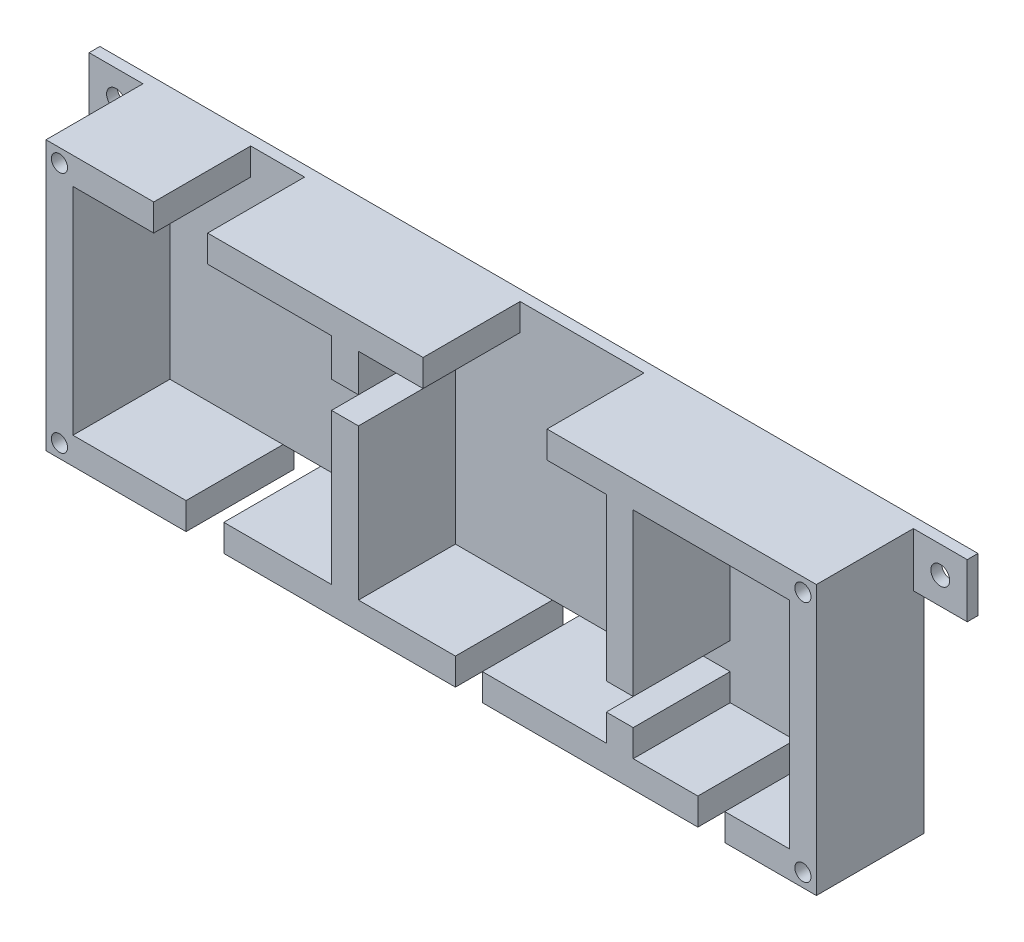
ISO-10303-21;
HEADER;
FILE_DESCRIPTION(('STEP AP214'),'2;1');
FILE_NAME('part.step','',(''),(''),'','','');
FILE_SCHEMA(('AUTOMOTIVE_DESIGN { 1 0 10303 214 1 1 1 1 }'));
ENDSEC;
DATA;
#1=APPLICATION_CONTEXT('core data for automotive mechanical design processes');
#2=APPLICATION_PROTOCOL_DEFINITION('international standard','automotive_design',2000,#1);
#3=PRODUCT_CONTEXT('',#1,'mechanical');
#4=PRODUCT('Part','Part','',(#3));
#5=PRODUCT_RELATED_PRODUCT_CATEGORY('part','',(#4));
#6=PRODUCT_DEFINITION_FORMATION('','',#4);
#7=PRODUCT_DEFINITION_CONTEXT('part definition',#1,'design');
#8=PRODUCT_DEFINITION('design','',#6,#7);
#9=PRODUCT_DEFINITION_SHAPE('','',#8);
#10=(LENGTH_UNIT() NAMED_UNIT(*) SI_UNIT(.MILLI.,.METRE.));
#11=(NAMED_UNIT(*) PLANE_ANGLE_UNIT() SI_UNIT($,.RADIAN.));
#12=(NAMED_UNIT(*) SI_UNIT($,.STERADIAN.) SOLID_ANGLE_UNIT());
#13=UNCERTAINTY_MEASURE_WITH_UNIT(LENGTH_MEASURE(1.E-05),#10,'distance_accuracy_value','');
#14=(GEOMETRIC_REPRESENTATION_CONTEXT(3) GLOBAL_UNCERTAINTY_ASSIGNED_CONTEXT((#13)) GLOBAL_UNIT_ASSIGNED_CONTEXT((#10,
#11,#12)) REPRESENTATION_CONTEXT('',''));
#15=CARTESIAN_POINT('',(0.,0.,0.));
#16=DIRECTION('',(0.,0.,1.));
#17=DIRECTION('',(1.,0.,0.));
#18=AXIS2_PLACEMENT_3D('',#15,#16,#17);
#19=CARTESIAN_POINT('',(0.,-20.,2.));
#20=DIRECTION('',(0.,1.,0.));
#21=DIRECTION('',(0.,0.,1.));
#22=AXIS2_PLACEMENT_3D('',#19,#20,#21);
#23=PLANE('',#22);
#24=DIRECTION('',(0.,0.,-1.));
#25=VECTOR('',#24,1.);
#26=CARTESIAN_POINT('',(9.50000000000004,-20.,20.));
#27=LINE('',#26,#25);
#28=CARTESIAN_POINT('',(9.50000000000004,-20.,2.));
#29=VERTEX_POINT('',#28);
#30=CARTESIAN_POINT('',(9.50000000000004,-20.,0.));
#31=VERTEX_POINT('',#30);
#32=EDGE_CURVE('E479',#29,#31,#27,.T.);
#33=ORIENTED_EDGE('',*,*,#32,.F.);
#34=DIRECTION('',(1.,0.,0.));
#35=VECTOR('',#34,1.);
#36=CARTESIAN_POINT('',(0.,-20.,2.));
#37=LINE('',#36,#35);
#38=CARTESIAN_POINT('',(4.50000000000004,-20.,2.));
#39=VERTEX_POINT('',#38);
#40=EDGE_CURVE('E779',#39,#29,#37,.T.);
#41=ORIENTED_EDGE('',*,*,#40,.F.);
#42=DIRECTION('',(0.,0.,-1.));
#43=VECTOR('',#42,1.);
#44=CARTESIAN_POINT('',(4.50000000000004,-20.,20.));
#45=LINE('',#44,#43);
#46=CARTESIAN_POINT('',(4.50000000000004,-20.,0.));
#47=VERTEX_POINT('',#46);
#48=EDGE_CURVE('E525',#39,#47,#45,.T.);
#49=ORIENTED_EDGE('',*,*,#48,.T.);
#50=DIRECTION('',(1.,0.,0.));
#51=VECTOR('',#50,1.);
#52=CARTESIAN_POINT('',(0.,-20.,0.));
#53=LINE('',#52,#51);
#54=EDGE_CURVE('E816',#47,#31,#53,.T.);
#55=ORIENTED_EDGE('',*,*,#54,.T.);
#56=EDGE_LOOP('',(#33,#41,#49,#55));
#57=FACE_BOUND('',#56,.T.);
#58=ADVANCED_FACE('F99',(#57),#23,.F.);
#59=DIRECTION('',(0.,0.,-1.));
#60=VECTOR('',#59,1.);
#61=CARTESIAN_POINT('',(-38.5,-20.,20.));
#62=LINE('',#61,#60);
#63=CARTESIAN_POINT('',(-38.5,-20.,2.));
#64=VERTEX_POINT('',#63);
#65=CARTESIAN_POINT('',(-38.5,-20.,0.));
#66=VERTEX_POINT('',#65);
#67=EDGE_CURVE('E534',#64,#66,#62,.T.);
#68=ORIENTED_EDGE('',*,*,#67,.F.);
#69=CARTESIAN_POINT('',(-45.5,-20.,2.));
#70=VERTEX_POINT('',#69);
#71=EDGE_CURVE('E780',#70,#64,#37,.T.);
#72=ORIENTED_EDGE('',*,*,#71,.F.);
#73=DIRECTION('',(0.,0.,-1.));
#74=VECTOR('',#73,1.);
#75=CARTESIAN_POINT('',(-45.5,-20.,2.));
#76=LINE('',#75,#74);
#77=CARTESIAN_POINT('',(-45.5,-20.,0.));
#78=VERTEX_POINT('',#77);
#79=EDGE_CURVE('E789',#70,#78,#76,.T.);
#80=ORIENTED_EDGE('',*,*,#79,.T.);
#81=EDGE_CURVE('E817',#78,#66,#53,.T.);
#82=ORIENTED_EDGE('',*,*,#81,.T.);
#83=EDGE_LOOP('',(#68,#72,#80,#82));
#84=FACE_BOUND('',#83,.T.);
#85=ADVANCED_FACE('F965',(#84),#23,.F.);
#86=CARTESIAN_POINT('',(0.,0.,2.));
#87=DIRECTION('',(0.,0.,1.));
#88=DIRECTION('',(1.,0.,0.));
#89=AXIS2_PLACEMENT_3D('',#86,#87,#88);
#90=PLANE('',#89);
#91=CARTESIAN_POINT('',(76.5,20.,2.));
#92=DIRECTION('',(0.,0.,1.));
#93=DIRECTION('',(1.,0.,0.));
#94=AXIS2_PLACEMENT_3D('',#91,#92,#93);
#95=CIRCLE('',#94,1.75);
#96=CARTESIAN_POINT('',(78.25,20.,2.));
#97=VERTEX_POINT('',#96);
#98=EDGE_CURVE('E786',#97,#97,#95,.F.);
#99=ORIENTED_EDGE('',*,*,#98,.T.);
#100=EDGE_LOOP('',(#99));
#101=FACE_BOUND('',#100,.T.);
#102=DIRECTION('',(1.,0.,0.));
#103=VECTOR('',#102,1.);
#104=CARTESIAN_POINT('',(0.,25.,2.));
#105=LINE('',#104,#103);
#106=CARTESIAN_POINT('',(71.5,25.,2.));
#107=VERTEX_POINT('',#106);
#108=CARTESIAN_POINT('',(81.5,25.,2.));
#109=VERTEX_POINT('',#108);
#110=EDGE_CURVE('E770',#107,#109,#105,.T.);
#111=ORIENTED_EDGE('',*,*,#110,.F.);
#112=DIRECTION('',(0.,-1.,0.));
#113=VECTOR('',#112,1.);
#114=CARTESIAN_POINT('',(71.5,0.,2.));
#115=LINE('',#114,#113);
#116=CARTESIAN_POINT('',(71.5,15.,2.));
#117=VERTEX_POINT('',#116);
#118=EDGE_CURVE('E640',#107,#117,#115,.T.);
#119=ORIENTED_EDGE('',*,*,#118,.T.);
#120=DIRECTION('',(-1.,0.,0.));
#121=VECTOR('',#120,1.);
#122=CARTESIAN_POINT('',(0.,15.,2.));
#123=LINE('',#122,#121);
#124=CARTESIAN_POINT('',(81.5,15.,2.));
#125=VERTEX_POINT('',#124);
#126=EDGE_CURVE('E764',#125,#117,#123,.T.);
#127=ORIENTED_EDGE('',*,*,#126,.F.);
#128=DIRECTION('',(0.,-1.,0.));
#129=VECTOR('',#128,1.);
#130=CARTESIAN_POINT('',(81.4999999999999,-1.13103970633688E-13,2.));
#131=LINE('',#130,#129);
#132=EDGE_CURVE('E767',#109,#125,#131,.T.);
#133=ORIENTED_EDGE('',*,*,#132,.F.);
#134=EDGE_LOOP('',(#111,#119,#127,#133));
#135=FACE_BOUND('',#134,.T.);
#136=ADVANCED_FACE('F861',(#101,#135),#90,.T.);
#137=DIRECTION('',(0.,1.,0.));
#138=VECTOR('',#137,1.);
#139=CARTESIAN_POINT('',(37.5,0.,2.));
#140=LINE('',#139,#138);
#141=CARTESIAN_POINT('',(37.5,-20.,2.));
#142=VERTEX_POINT('',#141);
#143=CARTESIAN_POINT('',(37.5,-15.,2.));
#144=VERTEX_POINT('',#143);
#145=EDGE_CURVE('E432',#142,#144,#140,.T.);
#146=ORIENTED_EDGE('',*,*,#145,.F.);
#147=DIRECTION('',(-1.,0.,0.));
#148=VECTOR('',#147,1.);
#149=CARTESIAN_POINT('',(0.,-20.,2.));
#150=LINE('',#149,#148);
#151=CARTESIAN_POINT('',(49.5,-20.,2.));
#152=VERTEX_POINT('',#151);
#153=EDGE_CURVE('E435',#152,#142,#150,.T.);
#154=ORIENTED_EDGE('',*,*,#153,.F.);
#155=DIRECTION('',(0.,-1.,0.));
#156=VECTOR('',#155,1.);
#157=CARTESIAN_POINT('',(49.5,0.,2.));
#158=LINE('',#157,#156);
#159=CARTESIAN_POINT('',(49.5,-25.,2.));
#160=VERTEX_POINT('',#159);
#161=EDGE_CURVE('E758',#152,#160,#158,.T.);
#162=ORIENTED_EDGE('',*,*,#161,.T.);
#163=DIRECTION('',(1.,0.,0.));
#164=VECTOR('',#163,1.);
#165=CARTESIAN_POINT('',(0.,-25.,2.));
#166=LINE('',#165,#164);
#167=CARTESIAN_POINT('',(54.5,-25.,2.));
#168=VERTEX_POINT('',#167);
#169=EDGE_CURVE('E761',#160,#168,#166,.T.);
#170=ORIENTED_EDGE('',*,*,#169,.T.);
#171=DIRECTION('',(0.,1.,0.));
#172=VECTOR('',#171,1.);
#173=CARTESIAN_POINT('',(54.5,0.,2.));
#174=LINE('',#173,#172);
#175=CARTESIAN_POINT('',(54.5,-20.,2.));
#176=VERTEX_POINT('',#175);
#177=EDGE_CURVE('E642',#168,#176,#174,.T.);
#178=ORIENTED_EDGE('',*,*,#177,.T.);
#179=DIRECTION('',(-1.,0.,0.));
#180=VECTOR('',#179,1.);
#181=CARTESIAN_POINT('',(0.,-20.,2.));
#182=LINE('',#181,#180);
#183=CARTESIAN_POINT('',(66.5,-20.,2.));
#184=VERTEX_POINT('',#183);
#185=EDGE_CURVE('E644',#184,#176,#182,.T.);
#186=ORIENTED_EDGE('',*,*,#185,.F.);
#187=DIRECTION('',(0.,-1.,0.));
#188=VECTOR('',#187,1.);
#189=CARTESIAN_POINT('',(66.5,0.,2.));
#190=LINE('',#189,#188);
#191=CARTESIAN_POINT('',(66.5,20.,2.));
#192=VERTEX_POINT('',#191);
#193=EDGE_CURVE('E623',#192,#184,#190,.T.);
#194=ORIENTED_EDGE('',*,*,#193,.F.);
#195=DIRECTION('',(-1.,0.,0.));
#196=VECTOR('',#195,1.);
#197=CARTESIAN_POINT('',(0.,20.,2.));
#198=LINE('',#197,#196);
#199=CARTESIAN_POINT('',(37.5,20.,2.));
#200=VERTEX_POINT('',#199);
#201=EDGE_CURVE('E626',#192,#200,#198,.T.);
#202=ORIENTED_EDGE('',*,*,#201,.T.);
#203=DIRECTION('',(0.,1.,0.));
#204=VECTOR('',#203,1.);
#205=CARTESIAN_POINT('',(37.5,0.,2.));
#206=LINE('',#205,#204);
#207=CARTESIAN_POINT('',(37.5,-9.99999999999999,2.));
#208=VERTEX_POINT('',#207);
#209=EDGE_CURVE('E628',#208,#200,#206,.T.);
#210=ORIENTED_EDGE('',*,*,#209,.F.);
#211=DIRECTION('',(-1.,0.,0.));
#212=VECTOR('',#211,1.);
#213=CARTESIAN_POINT('',(0.,-9.99999999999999,2.));
#214=LINE('',#213,#212);
#215=CARTESIAN_POINT('',(32.5,-9.99999999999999,2.));
#216=VERTEX_POINT('',#215);
#217=EDGE_CURVE('E631',#208,#216,#214,.T.);
#218=ORIENTED_EDGE('',*,*,#217,.T.);
#219=DIRECTION('',(0.,1.,0.));
#220=VECTOR('',#219,1.);
#221=CARTESIAN_POINT('',(32.5,0.,2.));
#222=LINE('',#221,#220);
#223=CARTESIAN_POINT('',(32.5,20.,2.));
#224=VERTEX_POINT('',#223);
#225=EDGE_CURVE('E633',#216,#224,#222,.T.);
#226=ORIENTED_EDGE('',*,*,#225,.T.);
#227=DIRECTION('',(-1.,0.,0.));
#228=VECTOR('',#227,1.);
#229=CARTESIAN_POINT('',(0.,20.,2.));
#230=LINE('',#229,#228);
#231=CARTESIAN_POINT('',(21.5,20.,2.));
#232=VERTEX_POINT('',#231);
#233=EDGE_CURVE('E635',#224,#232,#230,.T.);
#234=ORIENTED_EDGE('',*,*,#233,.T.);
#235=DIRECTION('',(0.,-1.,0.));
#236=VECTOR('',#235,1.);
#237=CARTESIAN_POINT('',(21.5,0.,2.));
#238=LINE('',#237,#236);
#239=CARTESIAN_POINT('',(21.5,25.,2.));
#240=VERTEX_POINT('',#239);
#241=EDGE_CURVE('E637',#240,#232,#238,.T.);
#242=ORIENTED_EDGE('',*,*,#241,.F.);
#243=CARTESIAN_POINT('',(-1.49999999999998,25.,2.));
#244=VERTEX_POINT('',#243);
#245=EDGE_CURVE('E934',#244,#240,#105,.T.);
#246=ORIENTED_EDGE('',*,*,#245,.F.);
#247=DIRECTION('',(0.,-1.,0.));
#248=VECTOR('',#247,1.);
#249=CARTESIAN_POINT('',(-1.49999999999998,0.,2.));
#250=LINE('',#249,#248);
#251=CARTESIAN_POINT('',(-1.49999999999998,20.,2.));
#252=VERTEX_POINT('',#251);
#253=EDGE_CURVE('E687',#244,#252,#250,.T.);
#254=ORIENTED_EDGE('',*,*,#253,.T.);
#255=DIRECTION('',(-1.,0.,0.));
#256=VECTOR('',#255,1.);
#257=CARTESIAN_POINT('',(0.,20.,2.));
#258=LINE('',#257,#256);
#259=CARTESIAN_POINT('',(-13.5,20.,2.));
#260=VERTEX_POINT('',#259);
#261=EDGE_CURVE('E690',#252,#260,#258,.T.);
#262=ORIENTED_EDGE('',*,*,#261,.T.);
#263=DIRECTION('',(0.,1.,0.));
#264=VECTOR('',#263,1.);
#265=CARTESIAN_POINT('',(-13.5,0.,2.));
#266=LINE('',#265,#264);
#267=CARTESIAN_POINT('',(-13.5,13.,2.));
#268=VERTEX_POINT('',#267);
#269=EDGE_CURVE('E693',#268,#260,#266,.T.);
#270=ORIENTED_EDGE('',*,*,#269,.F.);
#271=DIRECTION('',(-1.,0.,0.));
#272=VECTOR('',#271,1.);
#273=CARTESIAN_POINT('',(0.,13.,2.));
#274=LINE('',#273,#272);
#275=CARTESIAN_POINT('',(-18.5,13.,2.));
#276=VERTEX_POINT('',#275);
#277=EDGE_CURVE('E695',#268,#276,#274,.T.);
#278=ORIENTED_EDGE('',*,*,#277,.T.);
#279=DIRECTION('',(0.,1.,0.));
#280=VECTOR('',#279,1.);
#281=CARTESIAN_POINT('',(-18.5,0.,2.));
#282=LINE('',#281,#280);
#283=CARTESIAN_POINT('',(-18.5,20.,2.));
#284=VERTEX_POINT('',#283);
#285=EDGE_CURVE('E698',#276,#284,#282,.T.);
#286=ORIENTED_EDGE('',*,*,#285,.T.);
#287=DIRECTION('',(-1.,0.,0.));
#288=VECTOR('',#287,1.);
#289=CARTESIAN_POINT('',(0.,20.,2.));
#290=LINE('',#289,#288);
#291=CARTESIAN_POINT('',(-41.5,20.,2.));
#292=VERTEX_POINT('',#291);
#293=EDGE_CURVE('E701',#284,#292,#290,.T.);
#294=ORIENTED_EDGE('',*,*,#293,.T.);
#295=DIRECTION('',(0.,-1.,0.));
#296=VECTOR('',#295,1.);
#297=CARTESIAN_POINT('',(-41.5,0.,2.));
#298=LINE('',#297,#296);
#299=CARTESIAN_POINT('',(-41.5,25.,2.));
#300=VERTEX_POINT('',#299);
#301=EDGE_CURVE('E704',#300,#292,#298,.T.);
#302=ORIENTED_EDGE('',*,*,#301,.F.);
#303=CARTESIAN_POINT('',(-51.5,25.,2.));
#304=VERTEX_POINT('',#303);
#305=EDGE_CURVE('E775',#304,#300,#105,.T.);
#306=ORIENTED_EDGE('',*,*,#305,.F.);
#307=DIRECTION('',(0.,-1.,0.));
#308=VECTOR('',#307,1.);
#309=CARTESIAN_POINT('',(-51.5,0.,2.));
#310=LINE('',#309,#308);
#311=CARTESIAN_POINT('',(-51.5,20.,2.));
#312=VERTEX_POINT('',#311);
#313=EDGE_CURVE('E748',#304,#312,#310,.T.);
#314=ORIENTED_EDGE('',*,*,#313,.T.);
#315=DIRECTION('',(-1.,0.,0.));
#316=VECTOR('',#315,1.);
#317=CARTESIAN_POINT('',(0.,20.,2.));
#318=LINE('',#317,#316);
#319=CARTESIAN_POINT('',(-66.5,20.,2.));
#320=VERTEX_POINT('',#319);
#321=EDGE_CURVE('E750',#312,#320,#318,.T.);
#322=ORIENTED_EDGE('',*,*,#321,.T.);
#323=DIRECTION('',(0.,-1.,0.));
#324=VECTOR('',#323,1.);
#325=CARTESIAN_POINT('',(-66.5,0.,2.));
#326=LINE('',#325,#324);
#327=CARTESIAN_POINT('',(-66.5,-20.,2.));
#328=VERTEX_POINT('',#327);
#329=EDGE_CURVE('E752',#320,#328,#326,.T.);
#330=ORIENTED_EDGE('',*,*,#329,.T.);
#331=DIRECTION('',(-1.,0.,0.));
#332=VECTOR('',#331,1.);
#333=CARTESIAN_POINT('',(0.,-20.,2.));
#334=LINE('',#333,#332);
#335=EDGE_CURVE('E754',#70,#328,#334,.T.);
#336=ORIENTED_EDGE('',*,*,#335,.F.);
#337=ORIENTED_EDGE('',*,*,#71,.T.);
#338=DIRECTION('',(-1.,0.,0.));
#339=VECTOR('',#338,1.);
#340=CARTESIAN_POINT('',(0.,-20.,2.));
#341=LINE('',#340,#339);
#342=CARTESIAN_POINT('',(-18.5,-20.,2.));
#343=VERTEX_POINT('',#342);
#344=EDGE_CURVE('E550',#343,#64,#341,.T.);
#345=ORIENTED_EDGE('',*,*,#344,.F.);
#346=DIRECTION('',(0.,1.,0.));
#347=VECTOR('',#346,1.);
#348=CARTESIAN_POINT('',(-18.5,0.,2.));
#349=LINE('',#348,#347);
#350=CARTESIAN_POINT('',(-18.5,8.,2.));
#351=VERTEX_POINT('',#350);
#352=EDGE_CURVE('E553',#343,#351,#349,.T.);
#353=ORIENTED_EDGE('',*,*,#352,.T.);
#354=DIRECTION('',(-1.,0.,0.));
#355=VECTOR('',#354,1.);
#356=CARTESIAN_POINT('',(0.,8.,2.));
#357=LINE('',#356,#355);
#358=CARTESIAN_POINT('',(-13.5,8.,2.));
#359=VERTEX_POINT('',#358);
#360=EDGE_CURVE('E555',#359,#351,#357,.T.);
#361=ORIENTED_EDGE('',*,*,#360,.F.);
#362=DIRECTION('',(0.,1.,0.));
#363=VECTOR('',#362,1.);
#364=CARTESIAN_POINT('',(-13.5,0.,2.));
#365=LINE('',#364,#363);
#366=CARTESIAN_POINT('',(-13.5,-20.,2.));
#367=VERTEX_POINT('',#366);
#368=EDGE_CURVE('E558',#367,#359,#365,.T.);
#369=ORIENTED_EDGE('',*,*,#368,.F.);
#370=DIRECTION('',(-1.,0.,0.));
#371=VECTOR('',#370,1.);
#372=CARTESIAN_POINT('',(0.,-20.,2.));
#373=LINE('',#372,#371);
#374=EDGE_CURVE('E547',#39,#367,#373,.T.);
#375=ORIENTED_EDGE('',*,*,#374,.F.);
#376=ORIENTED_EDGE('',*,*,#40,.T.);
#377=DIRECTION('',(-1.,0.,0.));
#378=VECTOR('',#377,1.);
#379=CARTESIAN_POINT('',(0.,-20.,2.));
#380=LINE('',#379,#378);
#381=CARTESIAN_POINT('',(32.5,-20.,2.));
#382=VERTEX_POINT('',#381);
#383=EDGE_CURVE('E489',#382,#29,#380,.T.);
#384=ORIENTED_EDGE('',*,*,#383,.F.);
#385=DIRECTION('',(0.,1.,0.));
#386=VECTOR('',#385,1.);
#387=CARTESIAN_POINT('',(32.5,0.,2.));
#388=LINE('',#387,#386);
#389=CARTESIAN_POINT('',(32.5,-15.,2.));
#390=VERTEX_POINT('',#389);
#391=EDGE_CURVE('E119',#382,#390,#388,.T.);
#392=ORIENTED_EDGE('',*,*,#391,.T.);
#393=DIRECTION('',(-1.,0.,0.));
#394=VECTOR('',#393,1.);
#395=CARTESIAN_POINT('',(0.,-15.,2.));
#396=LINE('',#395,#394);
#397=EDGE_CURVE('E114',#144,#390,#396,.T.);
#398=ORIENTED_EDGE('',*,*,#397,.F.);
#399=EDGE_LOOP('',(#146,#154,#162,#170,#178,#186,#194,#202,#210,#218,#226,#234,#242,#246,#254,
#262,#270,#278,#286,#294,#302,#306,#314,#322,#330,#336,#337,#345,#353,#361,#369,#375,#376,#384,
#392,#398));
#400=FACE_BOUND('',#399,.T.);
#401=ADVANCED_FACE('F919',(#400),#90,.T.);
#402=CARTESIAN_POINT('',(0.,-25.,2.));
#403=DIRECTION('',(0.,1.,0.));
#404=DIRECTION('',(0.,0.,1.));
#405=AXIS2_PLACEMENT_3D('',#402,#403,#404);
#406=PLANE('',#405);
#407=DIRECTION('',(0.,0.,-1.));
#408=VECTOR('',#407,1.);
#409=CARTESIAN_POINT('',(71.5,-25.,2.));
#410=LINE('',#409,#408);
#411=CARTESIAN_POINT('',(71.5,-25.,20.));
#412=VERTEX_POINT('',#411);
#413=CARTESIAN_POINT('',(71.5,-25.,0.));
#414=VERTEX_POINT('',#413);
#415=EDGE_CURVE('E12',#412,#414,#410,.T.);
#416=ORIENTED_EDGE('',*,*,#415,.F.);
#417=DIRECTION('',(1.,0.,0.));
#418=VECTOR('',#417,1.);
#419=CARTESIAN_POINT('',(0.,-25.,20.));
#420=LINE('',#419,#418);
#421=CARTESIAN_POINT('',(54.5,-25.,20.));
#422=VERTEX_POINT('',#421);
#423=EDGE_CURVE('E566',#422,#412,#420,.T.);
#424=ORIENTED_EDGE('',*,*,#423,.F.);
#425=DIRECTION('',(0.,0.,-1.));
#426=VECTOR('',#425,1.);
#427=CARTESIAN_POINT('',(54.5,-25.,20.));
#428=LINE('',#427,#426);
#429=EDGE_CURVE('E617',#422,#168,#428,.T.);
#430=ORIENTED_EDGE('',*,*,#429,.T.);
#431=ORIENTED_EDGE('',*,*,#169,.F.);
#432=DIRECTION('',(0.,0.,-1.));
#433=VECTOR('',#432,1.);
#434=CARTESIAN_POINT('',(49.5,-25.,20.));
#435=LINE('',#434,#433);
#436=CARTESIAN_POINT('',(49.5,-25.,20.));
#437=VERTEX_POINT('',#436);
#438=EDGE_CURVE('E473',#437,#160,#435,.T.);
#439=ORIENTED_EDGE('',*,*,#438,.F.);
#440=DIRECTION('',(1.,0.,0.));
#441=VECTOR('',#440,1.);
#442=CARTESIAN_POINT('',(0.,-25.,20.));
#443=LINE('',#442,#441);
#444=CARTESIAN_POINT('',(9.50000000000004,-25.,20.));
#445=VERTEX_POINT('',#444);
#446=EDGE_CURVE('E460',#445,#437,#443,.T.);
#447=ORIENTED_EDGE('',*,*,#446,.F.);
#448=DIRECTION('',(0.,0.,-1.));
#449=VECTOR('',#448,1.);
#450=CARTESIAN_POINT('',(9.50000000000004,-25.,20.));
#451=LINE('',#450,#449);
#452=CARTESIAN_POINT('',(9.50000000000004,-25.,0.));
#453=VERTEX_POINT('',#452);
#454=EDGE_CURVE('E476',#445,#453,#451,.T.);
#455=ORIENTED_EDGE('',*,*,#454,.T.);
#456=DIRECTION('',(1.,0.,0.));
#457=VECTOR('',#456,1.);
#458=CARTESIAN_POINT('',(0.,-25.,0.));
#459=LINE('',#458,#457);
#460=EDGE_CURVE('E757',#453,#414,#459,.T.);
#461=ORIENTED_EDGE('',*,*,#460,.T.);
#462=EDGE_LOOP('',(#416,#424,#430,#431,#439,#447,#455,#461));
#463=FACE_BOUND('',#462,.T.);
#464=ADVANCED_FACE('F101',(#463),#406,.F.);
#465=CARTESIAN_POINT('',(71.5,0.,2.));
#466=DIRECTION('',(-1.,0.,0.));
#467=DIRECTION('',(0.,-1.,0.));
#468=AXIS2_PLACEMENT_3D('',#465,#466,#467);
#469=PLANE('',#468);
#470=DIRECTION('',(0.,1.,0.));
#471=VECTOR('',#470,1.);
#472=CARTESIAN_POINT('',(71.5,0.,0.));
#473=LINE('',#472,#471);
#474=CARTESIAN_POINT('',(71.5,15.,0.));
#475=VERTEX_POINT('',#474);
#476=EDGE_CURVE('E791',#414,#475,#473,.T.);
#477=ORIENTED_EDGE('',*,*,#476,.T.);
#478=DIRECTION('',(0.,0.,-1.));
#479=VECTOR('',#478,1.);
#480=CARTESIAN_POINT('',(71.5,15.,2.));
#481=LINE('',#480,#479);
#482=EDGE_CURVE('E107',#117,#475,#481,.T.);
#483=ORIENTED_EDGE('',*,*,#482,.F.);
#484=ORIENTED_EDGE('',*,*,#118,.F.);
#485=DIRECTION('',(0.,0.,-1.));
#486=VECTOR('',#485,1.);
#487=CARTESIAN_POINT('',(71.5,25.,20.));
#488=LINE('',#487,#486);
#489=CARTESIAN_POINT('',(71.5,25.,20.));
#490=VERTEX_POINT('',#489);
#491=EDGE_CURVE('E614',#490,#107,#488,.T.);
#492=ORIENTED_EDGE('',*,*,#491,.F.);
#493=DIRECTION('',(0.,1.,0.));
#494=VECTOR('',#493,1.);
#495=CARTESIAN_POINT('',(71.5,0.,20.));
#496=LINE('',#495,#494);
#497=EDGE_CURVE('E569',#412,#490,#496,.T.);
#498=ORIENTED_EDGE('',*,*,#497,.F.);
#499=ORIENTED_EDGE('',*,*,#415,.T.);
#500=EDGE_LOOP('',(#477,#483,#484,#492,#498,#499));
#501=FACE_BOUND('',#500,.T.);
#502=ADVANCED_FACE('F848',(#501),#469,.F.);
#503=CARTESIAN_POINT('',(0.,15.,2.));
#504=DIRECTION('',(0.,-1.,0.));
#505=DIRECTION('',(0.,0.,-1.));
#506=AXIS2_PLACEMENT_3D('',#503,#504,#505);
#507=PLANE('',#506);
#508=DIRECTION('',(-1.,0.,0.));
#509=VECTOR('',#508,1.);
#510=CARTESIAN_POINT('',(0.,15.,0.));
#511=LINE('',#510,#509);
#512=CARTESIAN_POINT('',(81.5,15.,0.));
#513=VERTEX_POINT('',#512);
#514=EDGE_CURVE('E794',#513,#475,#511,.T.);
#515=ORIENTED_EDGE('',*,*,#514,.F.);
#516=DIRECTION('',(0.,0.,-1.));
#517=VECTOR('',#516,1.);
#518=CARTESIAN_POINT('',(81.5,15.,2.));
#519=LINE('',#518,#517);
#520=EDGE_CURVE('E839',#125,#513,#519,.T.);
#521=ORIENTED_EDGE('',*,*,#520,.F.);
#522=ORIENTED_EDGE('',*,*,#126,.T.);
#523=ORIENTED_EDGE('',*,*,#482,.T.);
#524=EDGE_LOOP('',(#515,#521,#522,#523));
#525=FACE_BOUND('',#524,.T.);
#526=ADVANCED_FACE('F843',(#525),#507,.T.);
#527=CARTESIAN_POINT('',(81.4999999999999,-1.13103970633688E-13,2.));
#528=DIRECTION('',(1.,0.,0.));
#529=DIRECTION('',(0.,1.,0.));
#530=AXIS2_PLACEMENT_3D('',#527,#528,#529);
#531=PLANE('',#530);
#532=DIRECTION('',(0.,-1.,0.));
#533=VECTOR('',#532,1.);
#534=CARTESIAN_POINT('',(81.4999999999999,-1.13103970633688E-13,0.));
#535=LINE('',#534,#533);
#536=CARTESIAN_POINT('',(81.5,25.,0.));
#537=VERTEX_POINT('',#536);
#538=EDGE_CURVE('E797',#537,#513,#535,.T.);
#539=ORIENTED_EDGE('',*,*,#538,.F.);
#540=DIRECTION('',(0.,0.,-1.));
#541=VECTOR('',#540,1.);
#542=CARTESIAN_POINT('',(81.5,25.,2.));
#543=LINE('',#542,#541);
#544=EDGE_CURVE('E836',#109,#537,#543,.T.);
#545=ORIENTED_EDGE('',*,*,#544,.F.);
#546=ORIENTED_EDGE('',*,*,#132,.T.);
#547=ORIENTED_EDGE('',*,*,#520,.T.);
#548=EDGE_LOOP('',(#539,#545,#546,#547));
#549=FACE_BOUND('',#548,.T.);
#550=ADVANCED_FACE('F858',(#549),#531,.T.);
#551=CARTESIAN_POINT('',(0.,25.,2.));
#552=DIRECTION('',(0.,1.,0.));
#553=DIRECTION('',(-1.,0.,0.));
#554=AXIS2_PLACEMENT_3D('',#551,#552,#553);
#555=PLANE('',#554);
#556=ORIENTED_EDGE('',*,*,#245,.T.);
#557=DIRECTION('',(0.,0.,-1.));
#558=VECTOR('',#557,1.);
#559=CARTESIAN_POINT('',(21.5,25.,20.));
#560=LINE('',#559,#558);
#561=CARTESIAN_POINT('',(21.5,25.,20.));
#562=VERTEX_POINT('',#561);
#563=EDGE_CURVE('E611',#562,#240,#560,.T.);
#564=ORIENTED_EDGE('',*,*,#563,.F.);
#565=DIRECTION('',(1.,0.,0.));
#566=VECTOR('',#565,1.);
#567=CARTESIAN_POINT('',(0.,25.,20.));
#568=LINE('',#567,#566);
#569=EDGE_CURVE('E571',#562,#490,#568,.T.);
#570=ORIENTED_EDGE('',*,*,#569,.T.);
#571=ORIENTED_EDGE('',*,*,#491,.T.);
#572=ORIENTED_EDGE('',*,*,#110,.T.);
#573=ORIENTED_EDGE('',*,*,#544,.T.);
#574=DIRECTION('',(1.,0.,0.));
#575=VECTOR('',#574,1.);
#576=CARTESIAN_POINT('',(0.,25.,0.));
#577=LINE('',#576,#575);
#578=CARTESIAN_POINT('',(-81.5,25.,0.));
#579=VERTEX_POINT('',#578);
#580=EDGE_CURVE('E800',#579,#537,#577,.T.);
#581=ORIENTED_EDGE('',*,*,#580,.F.);
#582=DIRECTION('',(0.,0.,-1.));
#583=VECTOR('',#582,1.);
#584=CARTESIAN_POINT('',(-81.5,25.,2.));
#585=LINE('',#584,#583);
#586=CARTESIAN_POINT('',(-81.5,25.,2.));
#587=VERTEX_POINT('',#586);
#588=EDGE_CURVE('E834',#587,#579,#585,.T.);
#589=ORIENTED_EDGE('',*,*,#588,.F.);
#590=CARTESIAN_POINT('',(-71.5,25.,2.));
#591=VERTEX_POINT('',#590);
#592=EDGE_CURVE('E771',#587,#591,#105,.T.);
#593=ORIENTED_EDGE('',*,*,#592,.T.);
#594=DIRECTION('',(0.,0.,-1.));
#595=VECTOR('',#594,1.);
#596=CARTESIAN_POINT('',(-71.5,25.,20.));
#597=LINE('',#596,#595);
#598=CARTESIAN_POINT('',(-71.5,25.,20.));
#599=VERTEX_POINT('',#598);
#600=EDGE_CURVE('E727',#599,#591,#597,.T.);
#601=ORIENTED_EDGE('',*,*,#600,.F.);
#602=DIRECTION('',(1.,0.,0.));
#603=VECTOR('',#602,1.);
#604=CARTESIAN_POINT('',(0.,25.,20.));
#605=LINE('',#604,#603);
#606=CARTESIAN_POINT('',(-51.5,25.,20.));
#607=VERTEX_POINT('',#606);
#608=EDGE_CURVE('E718',#599,#607,#605,.T.);
#609=ORIENTED_EDGE('',*,*,#608,.T.);
#610=DIRECTION('',(0.,0.,-1.));
#611=VECTOR('',#610,1.);
#612=CARTESIAN_POINT('',(-51.5,25.,20.));
#613=LINE('',#612,#611);
#614=EDGE_CURVE('E730',#607,#304,#613,.T.);
#615=ORIENTED_EDGE('',*,*,#614,.T.);
#616=ORIENTED_EDGE('',*,*,#305,.T.);
#617=DIRECTION('',(0.,0.,-1.));
#618=VECTOR('',#617,1.);
#619=CARTESIAN_POINT('',(-41.5,25.,20.));
#620=LINE('',#619,#618);
#621=CARTESIAN_POINT('',(-41.5,25.,20.));
#622=VERTEX_POINT('',#621);
#623=EDGE_CURVE('E665',#622,#300,#620,.T.);
#624=ORIENTED_EDGE('',*,*,#623,.F.);
#625=DIRECTION('',(1.,0.,0.));
#626=VECTOR('',#625,1.);
#627=CARTESIAN_POINT('',(0.,25.,20.));
#628=LINE('',#627,#626);
#629=CARTESIAN_POINT('',(-1.49999999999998,25.,20.));
#630=VERTEX_POINT('',#629);
#631=EDGE_CURVE('E662',#622,#630,#628,.T.);
#632=ORIENTED_EDGE('',*,*,#631,.T.);
#633=DIRECTION('',(0.,0.,-1.));
#634=VECTOR('',#633,1.);
#635=CARTESIAN_POINT('',(-1.49999999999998,25.,20.));
#636=LINE('',#635,#634);
#637=EDGE_CURVE('E667',#630,#244,#636,.T.);
#638=ORIENTED_EDGE('',*,*,#637,.T.);
#639=EDGE_LOOP('',(#556,#564,#570,#571,#572,#573,#581,#589,#593,#601,#609,#615,#616,#624,#632,#638));
#640=FACE_BOUND('',#639,.T.);
#641=ADVANCED_FACE('F865',(#640),#555,.T.);
#642=CARTESIAN_POINT('',(-81.4999999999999,-1.13103970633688E-13,2.));
#643=DIRECTION('',(1.,0.,0.));
#644=DIRECTION('',(0.,1.,0.));
#645=AXIS2_PLACEMENT_3D('',#642,#643,#644);
#646=PLANE('',#645);
#647=DIRECTION('',(0.,-1.,0.));
#648=VECTOR('',#647,1.);
#649=CARTESIAN_POINT('',(-81.4999999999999,-1.13103970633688E-13,0.));
#650=LINE('',#649,#648);
#651=CARTESIAN_POINT('',(-81.5,15.,0.));
#652=VERTEX_POINT('',#651);
#653=EDGE_CURVE('E802',#579,#652,#650,.T.);
#654=ORIENTED_EDGE('',*,*,#653,.T.);
#655=DIRECTION('',(0.,0.,-1.));
#656=VECTOR('',#655,1.);
#657=CARTESIAN_POINT('',(-81.5,15.,2.));
#658=LINE('',#657,#656);
#659=CARTESIAN_POINT('',(-81.5,15.,2.));
#660=VERTEX_POINT('',#659);
#661=EDGE_CURVE('E831',#660,#652,#658,.T.);
#662=ORIENTED_EDGE('',*,*,#661,.F.);
#663=DIRECTION('',(0.,-1.,0.));
#664=VECTOR('',#663,1.);
#665=CARTESIAN_POINT('',(-81.4999999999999,-1.13103970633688E-13,2.));
#666=LINE('',#665,#664);
#667=EDGE_CURVE('E774',#587,#660,#666,.T.);
#668=ORIENTED_EDGE('',*,*,#667,.F.);
#669=ORIENTED_EDGE('',*,*,#588,.T.);
#670=EDGE_LOOP('',(#654,#662,#668,#669));
#671=FACE_BOUND('',#670,.T.);
#672=ADVANCED_FACE('F1031',(#671),#646,.F.);
#673=CARTESIAN_POINT('',(0.,15.,2.));
#674=DIRECTION('',(0.,1.,0.));
#675=DIRECTION('',(0.,0.,1.));
#676=AXIS2_PLACEMENT_3D('',#673,#674,#675);
#677=PLANE('',#676);
#678=DIRECTION('',(1.,0.,0.));
#679=VECTOR('',#678,1.);
#680=CARTESIAN_POINT('',(0.,15.,0.));
#681=LINE('',#680,#679);
#682=CARTESIAN_POINT('',(-71.5,15.,0.));
#683=VERTEX_POINT('',#682);
#684=EDGE_CURVE('E804',#652,#683,#681,.T.);
#685=ORIENTED_EDGE('',*,*,#684,.T.);
#686=DIRECTION('',(0.,0.,-1.));
#687=VECTOR('',#686,1.);
#688=CARTESIAN_POINT('',(-71.5,15.,2.));
#689=LINE('',#688,#687);
#690=CARTESIAN_POINT('',(-71.5,15.,2.));
#691=VERTEX_POINT('',#690);
#692=EDGE_CURVE('E829',#691,#683,#689,.T.);
#693=ORIENTED_EDGE('',*,*,#692,.F.);
#694=DIRECTION('',(1.,0.,0.));
#695=VECTOR('',#694,1.);
#696=CARTESIAN_POINT('',(0.,15.,2.));
#697=LINE('',#696,#695);
#698=EDGE_CURVE('E777',#660,#691,#697,.T.);
#699=ORIENTED_EDGE('',*,*,#698,.F.);
#700=ORIENTED_EDGE('',*,*,#661,.T.);
#701=EDGE_LOOP('',(#685,#693,#699,#700));
#702=FACE_BOUND('',#701,.T.);
#703=ADVANCED_FACE('F1027',(#702),#677,.F.);
#704=CARTESIAN_POINT('',(-71.5,0.,2.));
#705=DIRECTION('',(-1.,0.,0.));
#706=DIRECTION('',(0.,0.,1.));
#707=AXIS2_PLACEMENT_3D('',#704,#705,#706);
#708=PLANE('',#707);
#709=DIRECTION('',(0.,1.,0.));
#710=VECTOR('',#709,1.);
#711=CARTESIAN_POINT('',(-71.5,0.,0.));
#712=LINE('',#711,#710);
#713=CARTESIAN_POINT('',(-71.5,-25.,0.));
#714=VERTEX_POINT('',#713);
#715=EDGE_CURVE('E807',#714,#683,#712,.T.);
#716=ORIENTED_EDGE('',*,*,#715,.F.);
#717=DIRECTION('',(0.,0.,-1.));
#718=VECTOR('',#717,1.);
#719=CARTESIAN_POINT('',(-71.5,-25.,2.));
#720=LINE('',#719,#718);
#721=CARTESIAN_POINT('',(-71.5,-25.,20.));
#722=VERTEX_POINT('',#721);
#723=EDGE_CURVE('E827',#722,#714,#720,.T.);
#724=ORIENTED_EDGE('',*,*,#723,.F.);
#725=DIRECTION('',(0.,1.,0.));
#726=VECTOR('',#725,1.);
#727=CARTESIAN_POINT('',(-71.5,0.,20.));
#728=LINE('',#727,#726);
#729=EDGE_CURVE('E721',#722,#599,#728,.T.);
#730=ORIENTED_EDGE('',*,*,#729,.T.);
#731=ORIENTED_EDGE('',*,*,#600,.T.);
#732=DIRECTION('',(0.,-1.,0.));
#733=VECTOR('',#732,1.);
#734=CARTESIAN_POINT('',(-71.5,0.,2.));
#735=LINE('',#734,#733);
#736=EDGE_CURVE('E745',#591,#691,#735,.T.);
#737=ORIENTED_EDGE('',*,*,#736,.T.);
#738=ORIENTED_EDGE('',*,*,#692,.T.);
#739=EDGE_LOOP('',(#716,#724,#730,#731,#737,#738));
#740=FACE_BOUND('',#739,.T.);
#741=ADVANCED_FACE('F1023',(#740),#708,.T.);
#742=CARTESIAN_POINT('',(0.,-25.,2.));
#743=DIRECTION('',(0.,1.,0.));
#744=DIRECTION('',(0.,0.,1.));
#745=AXIS2_PLACEMENT_3D('',#742,#743,#744);
#746=PLANE('',#745);
#747=DIRECTION('',(1.,0.,0.));
#748=VECTOR('',#747,1.);
#749=CARTESIAN_POINT('',(0.,-25.,0.));
#750=LINE('',#749,#748);
#751=CARTESIAN_POINT('',(-45.5,-25.,0.));
#752=VERTEX_POINT('',#751);
#753=EDGE_CURVE('E810',#714,#752,#750,.T.);
#754=ORIENTED_EDGE('',*,*,#753,.T.);
#755=DIRECTION('',(0.,0.,-1.));
#756=VECTOR('',#755,1.);
#757=CARTESIAN_POINT('',(-45.5,-25.,2.));
#758=LINE('',#757,#756);
#759=CARTESIAN_POINT('',(-45.5,-25.,20.));
#760=VERTEX_POINT('',#759);
#761=EDGE_CURVE('E825',#760,#752,#758,.T.);
#762=ORIENTED_EDGE('',*,*,#761,.F.);
#763=DIRECTION('',(1.,0.,0.));
#764=VECTOR('',#763,1.);
#765=CARTESIAN_POINT('',(0.,-25.,20.));
#766=LINE('',#765,#764);
#767=EDGE_CURVE('E724',#722,#760,#766,.T.);
#768=ORIENTED_EDGE('',*,*,#767,.F.);
#769=ORIENTED_EDGE('',*,*,#723,.T.);
#770=EDGE_LOOP('',(#754,#762,#768,#769));
#771=FACE_BOUND('',#770,.T.);
#772=ADVANCED_FACE('F1020',(#771),#746,.F.);
#773=CARTESIAN_POINT('',(-45.5,0.,2.));
#774=DIRECTION('',(1.,0.,0.));
#775=DIRECTION('',(0.,0.,-1.));
#776=AXIS2_PLACEMENT_3D('',#773,#774,#775);
#777=PLANE('',#776);
#778=DIRECTION('',(0.,-1.,0.));
#779=VECTOR('',#778,1.);
#780=CARTESIAN_POINT('',(-45.5,0.,0.));
#781=LINE('',#780,#779);
#782=EDGE_CURVE('E813',#78,#752,#781,.T.);
#783=ORIENTED_EDGE('',*,*,#782,.F.);
#784=ORIENTED_EDGE('',*,*,#79,.F.);
#785=DIRECTION('',(0.,0.,-1.));
#786=VECTOR('',#785,1.);
#787=CARTESIAN_POINT('',(-45.5,-20.,20.));
#788=LINE('',#787,#786);
#789=CARTESIAN_POINT('',(-45.5,-20.,20.));
#790=VERTEX_POINT('',#789);
#791=EDGE_CURVE('E742',#790,#70,#788,.T.);
#792=ORIENTED_EDGE('',*,*,#791,.F.);
#793=DIRECTION('',(0.,-1.,0.));
#794=VECTOR('',#793,1.);
#795=CARTESIAN_POINT('',(-45.5,0.,20.));
#796=LINE('',#795,#794);
#797=EDGE_CURVE('E706',#790,#760,#796,.T.);
#798=ORIENTED_EDGE('',*,*,#797,.T.);
#799=ORIENTED_EDGE('',*,*,#761,.T.);
#800=EDGE_LOOP('',(#783,#784,#792,#798,#799));
#801=FACE_BOUND('',#800,.T.);
#802=ADVANCED_FACE('F961',(#801),#777,.T.);
#803=CARTESIAN_POINT('',(-76.5,20.,2.));
#804=DIRECTION('',(0.,0.,-1.));
#805=DIRECTION('',(-1.,0.,0.));
#806=AXIS2_PLACEMENT_3D('',#803,#804,#805);
#807=CYLINDRICAL_SURFACE('',#806,1.75);
#808=CARTESIAN_POINT('',(-76.5,20.,2.));
#809=DIRECTION('',(0.,0.,1.));
#810=DIRECTION('',(1.,0.,0.));
#811=AXIS2_PLACEMENT_3D('',#808,#809,#810);
#812=CIRCLE('',#811,1.75);
#813=CARTESIAN_POINT('',(-74.75,20.,2.));
#814=VERTEX_POINT('',#813);
#815=EDGE_CURVE('E783',#814,#814,#812,.T.);
#816=ORIENTED_EDGE('',*,*,#815,.T.);
#817=EDGE_LOOP('',(#816));
#818=FACE_BOUND('',#817,.T.);
#819=CARTESIAN_POINT('',(-76.5,20.,0.));
#820=DIRECTION('',(0.,0.,1.));
#821=DIRECTION('',(1.,0.,0.));
#822=AXIS2_PLACEMENT_3D('',#819,#820,#821);
#823=CIRCLE('',#822,1.75);
#824=CARTESIAN_POINT('',(-74.75,20.,0.));
#825=VERTEX_POINT('',#824);
#826=EDGE_CURVE('E819',#825,#825,#823,.T.);
#827=ORIENTED_EDGE('',*,*,#826,.F.);
#828=EDGE_LOOP('',(#827));
#829=FACE_BOUND('',#828,.T.);
#830=ADVANCED_FACE('F1016',(#818,#829),#807,.F.);
#831=CARTESIAN_POINT('',(76.5,20.,2.));
#832=DIRECTION('',(0.,0.,-1.));
#833=DIRECTION('',(-1.,0.,0.));
#834=AXIS2_PLACEMENT_3D('',#831,#832,#833);
#835=CYLINDRICAL_SURFACE('',#834,1.75);
#836=ORIENTED_EDGE('',*,*,#98,.F.);
#837=EDGE_LOOP('',(#836));
#838=FACE_BOUND('',#837,.T.);
#839=CARTESIAN_POINT('',(76.5,20.,0.));
#840=DIRECTION('',(0.,0.,1.));
#841=DIRECTION('',(1.,0.,0.));
#842=AXIS2_PLACEMENT_3D('',#839,#840,#841);
#843=CIRCLE('',#842,1.75);
#844=CARTESIAN_POINT('',(78.25,20.,0.));
#845=VERTEX_POINT('',#844);
#846=EDGE_CURVE('E762',#845,#845,#843,.F.);
#847=ORIENTED_EDGE('',*,*,#846,.T.);
#848=EDGE_LOOP('',(#847));
#849=FACE_BOUND('',#848,.T.);
#850=ADVANCED_FACE('F1057',(#838,#849),#835,.F.);
#851=ORIENTED_EDGE('',*,*,#736,.F.);
#852=ORIENTED_EDGE('',*,*,#592,.F.);
#853=ORIENTED_EDGE('',*,*,#667,.T.);
#854=ORIENTED_EDGE('',*,*,#698,.T.);
#855=EDGE_LOOP('',(#851,#852,#853,#854));
#856=FACE_BOUND('',#855,.T.);
#857=ORIENTED_EDGE('',*,*,#815,.F.);
#858=EDGE_LOOP('',(#857));
#859=FACE_BOUND('',#858,.T.);
#860=ADVANCED_FACE('F1049',(#856,#859),#90,.T.);
#861=CARTESIAN_POINT('',(0.,0.,0.));
#862=DIRECTION('',(0.,0.,1.));
#863=DIRECTION('',(1.,0.,0.));
#864=AXIS2_PLACEMENT_3D('',#861,#862,#863);
#865=PLANE('',#864);
#866=ORIENTED_EDGE('',*,*,#460,.F.);
#867=DIRECTION('',(0.,-1.,0.));
#868=VECTOR('',#867,1.);
#869=CARTESIAN_POINT('',(9.50000000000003,0.,0.));
#870=LINE('',#869,#868);
#871=EDGE_CURVE('E445',#31,#453,#870,.T.);
#872=ORIENTED_EDGE('',*,*,#871,.F.);
#873=ORIENTED_EDGE('',*,*,#54,.F.);
#874=DIRECTION('',(0.,-1.,0.));
#875=VECTOR('',#874,1.);
#876=CARTESIAN_POINT('',(4.50000000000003,0.,0.));
#877=LINE('',#876,#875);
#878=CARTESIAN_POINT('',(4.50000000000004,-25.,0.));
#879=VERTEX_POINT('',#878);
#880=EDGE_CURVE('E500',#47,#879,#877,.T.);
#881=ORIENTED_EDGE('',*,*,#880,.T.);
#882=DIRECTION('',(1.,0.,0.));
#883=VECTOR('',#882,1.);
#884=CARTESIAN_POINT('',(0.,-25.,0.));
#885=LINE('',#884,#883);
#886=CARTESIAN_POINT('',(-38.5,-25.,0.));
#887=VERTEX_POINT('',#886);
#888=EDGE_CURVE('E517',#887,#879,#885,.T.);
#889=ORIENTED_EDGE('',*,*,#888,.F.);
#890=DIRECTION('',(0.,-1.,0.));
#891=VECTOR('',#890,1.);
#892=CARTESIAN_POINT('',(-38.5,0.,0.));
#893=LINE('',#892,#891);
#894=EDGE_CURVE('E495',#66,#887,#893,.T.);
#895=ORIENTED_EDGE('',*,*,#894,.F.);
#896=ORIENTED_EDGE('',*,*,#81,.F.);
#897=ORIENTED_EDGE('',*,*,#782,.T.);
#898=ORIENTED_EDGE('',*,*,#753,.F.);
#899=ORIENTED_EDGE('',*,*,#715,.T.);
#900=ORIENTED_EDGE('',*,*,#684,.F.);
#901=ORIENTED_EDGE('',*,*,#653,.F.);
#902=ORIENTED_EDGE('',*,*,#580,.T.);
#903=ORIENTED_EDGE('',*,*,#538,.T.);
#904=ORIENTED_EDGE('',*,*,#514,.T.);
#905=ORIENTED_EDGE('',*,*,#476,.F.);
#906=EDGE_LOOP('',(#866,#872,#873,#881,#889,#895,#896,#897,#898,#899,#900,#901,#902,#903,#904,#905));
#907=FACE_BOUND('',#906,.T.);
#908=ORIENTED_EDGE('',*,*,#826,.T.);
#909=EDGE_LOOP('',(#908));
#910=FACE_BOUND('',#909,.T.);
#911=ORIENTED_EDGE('',*,*,#846,.F.);
#912=EDGE_LOOP('',(#911));
#913=FACE_BOUND('',#912,.T.);
#914=ADVANCED_FACE('F851',(#907,#910,#913),#865,.F.);
#915=CARTESIAN_POINT('',(0.,-20.,20.));
#916=DIRECTION('',(0.,1.,0.));
#917=DIRECTION('',(0.,0.,1.));
#918=AXIS2_PLACEMENT_3D('',#915,#916,#917);
#919=PLANE('',#918);
#920=ORIENTED_EDGE('',*,*,#791,.T.);
#921=ORIENTED_EDGE('',*,*,#335,.T.);
#922=DIRECTION('',(0.,0.,-1.));
#923=VECTOR('',#922,1.);
#924=CARTESIAN_POINT('',(-66.5,-20.,20.));
#925=LINE('',#924,#923);
#926=CARTESIAN_POINT('',(-66.5,-20.,20.));
#927=VERTEX_POINT('',#926);
#928=EDGE_CURVE('E739',#927,#328,#925,.T.);
#929=ORIENTED_EDGE('',*,*,#928,.F.);
#930=DIRECTION('',(1.,0.,0.));
#931=VECTOR('',#930,1.);
#932=CARTESIAN_POINT('',(0.,-20.,20.));
#933=LINE('',#932,#931);
#934=EDGE_CURVE('E709',#927,#790,#933,.T.);
#935=ORIENTED_EDGE('',*,*,#934,.T.);
#936=EDGE_LOOP('',(#920,#921,#929,#935));
#937=FACE_BOUND('',#936,.T.);
#938=ADVANCED_FACE('F956',(#937),#919,.T.);
#939=CARTESIAN_POINT('',(-66.5,0.,20.));
#940=DIRECTION('',(-1.,0.,0.));
#941=DIRECTION('',(0.,0.,1.));
#942=AXIS2_PLACEMENT_3D('',#939,#940,#941);
#943=PLANE('',#942);
#944=ORIENTED_EDGE('',*,*,#329,.F.);
#945=DIRECTION('',(0.,0.,-1.));
#946=VECTOR('',#945,1.);
#947=CARTESIAN_POINT('',(-66.5,20.,20.));
#948=LINE('',#947,#946);
#949=CARTESIAN_POINT('',(-66.5,20.,20.));
#950=VERTEX_POINT('',#949);
#951=EDGE_CURVE('E736',#950,#320,#948,.T.);
#952=ORIENTED_EDGE('',*,*,#951,.F.);
#953=DIRECTION('',(0.,1.,0.));
#954=VECTOR('',#953,1.);
#955=CARTESIAN_POINT('',(-66.5,0.,20.));
#956=LINE('',#955,#954);
#957=EDGE_CURVE('E712',#927,#950,#956,.T.);
#958=ORIENTED_EDGE('',*,*,#957,.F.);
#959=ORIENTED_EDGE('',*,*,#928,.T.);
#960=EDGE_LOOP('',(#944,#952,#958,#959));
#961=FACE_BOUND('',#960,.T.);
#962=ADVANCED_FACE('F952',(#961),#943,.F.);
#963=CARTESIAN_POINT('',(0.,20.,20.));
#964=DIRECTION('',(0.,1.,0.));
#965=DIRECTION('',(-1.,0.,0.));
#966=AXIS2_PLACEMENT_3D('',#963,#964,#965);
#967=PLANE('',#966);
#968=ORIENTED_EDGE('',*,*,#321,.F.);
#969=DIRECTION('',(0.,0.,-1.));
#970=VECTOR('',#969,1.);
#971=CARTESIAN_POINT('',(-51.5,20.,20.));
#972=LINE('',#971,#970);
#973=CARTESIAN_POINT('',(-51.5,20.,20.));
#974=VERTEX_POINT('',#973);
#975=EDGE_CURVE('E733',#974,#312,#972,.T.);
#976=ORIENTED_EDGE('',*,*,#975,.F.);
#977=DIRECTION('',(1.,0.,0.));
#978=VECTOR('',#977,1.);
#979=CARTESIAN_POINT('',(0.,20.,20.));
#980=LINE('',#979,#978);
#981=EDGE_CURVE('E714',#950,#974,#980,.T.);
#982=ORIENTED_EDGE('',*,*,#981,.F.);
#983=ORIENTED_EDGE('',*,*,#951,.T.);
#984=EDGE_LOOP('',(#968,#976,#982,#983));
#985=FACE_BOUND('',#984,.T.);
#986=ADVANCED_FACE('F948',(#985),#967,.F.);
#987=CARTESIAN_POINT('',(-51.5,0.,20.));
#988=DIRECTION('',(-1.,0.,0.));
#989=DIRECTION('',(0.,0.,1.));
#990=AXIS2_PLACEMENT_3D('',#987,#988,#989);
#991=PLANE('',#990);
#992=ORIENTED_EDGE('',*,*,#313,.F.);
#993=ORIENTED_EDGE('',*,*,#614,.F.);
#994=DIRECTION('',(0.,1.,0.));
#995=VECTOR('',#994,1.);
#996=CARTESIAN_POINT('',(-51.5,0.,20.));
#997=LINE('',#996,#995);
#998=EDGE_CURVE('E716',#974,#607,#997,.T.);
#999=ORIENTED_EDGE('',*,*,#998,.F.);
#1000=ORIENTED_EDGE('',*,*,#975,.T.);
#1001=EDGE_LOOP('',(#992,#993,#999,#1000));
#1002=FACE_BOUND('',#1001,.T.);
#1003=ADVANCED_FACE('F943',(#1002),#991,.F.);
#1004=CARTESIAN_POINT('',(0.,0.,20.));
#1005=DIRECTION('',(0.,0.,1.));
#1006=DIRECTION('',(1.,0.,0.));
#1007=AXIS2_PLACEMENT_3D('',#1004,#1005,#1006);
#1008=PLANE('',#1007);
#1009=CARTESIAN_POINT('',(-69.,-22.5,20.));
#1010=DIRECTION('',(0.,0.,1.));
#1011=DIRECTION('',(1.,0.,0.));
#1012=AXIS2_PLACEMENT_3D('',#1009,#1010,#1011);
#1013=CIRCLE('',#1012,1.5);
#1014=CARTESIAN_POINT('',(-67.5,-22.5,20.));
#1015=VERTEX_POINT('',#1014);
#1016=EDGE_CURVE('E1697',#1015,#1015,#1013,.T.);
#1017=ORIENTED_EDGE('',*,*,#1016,.F.);
#1018=EDGE_LOOP('',(#1017));
#1019=FACE_BOUND('',#1018,.T.);
#1020=CARTESIAN_POINT('',(-69.,22.5,20.));
#1021=DIRECTION('',(0.,0.,1.));
#1022=DIRECTION('',(1.,0.,0.));
#1023=AXIS2_PLACEMENT_3D('',#1020,#1021,#1022);
#1024=CIRCLE('',#1023,1.5);
#1025=CARTESIAN_POINT('',(-67.5,22.5,20.));
#1026=VERTEX_POINT('',#1025);
#1027=EDGE_CURVE('E1701',#1026,#1026,#1024,.T.);
#1028=ORIENTED_EDGE('',*,*,#1027,.F.);
#1029=EDGE_LOOP('',(#1028));
#1030=FACE_BOUND('',#1029,.T.);
#1031=ORIENTED_EDGE('',*,*,#797,.F.);
#1032=ORIENTED_EDGE('',*,*,#934,.F.);
#1033=ORIENTED_EDGE('',*,*,#957,.T.);
#1034=ORIENTED_EDGE('',*,*,#981,.T.);
#1035=ORIENTED_EDGE('',*,*,#998,.T.);
#1036=ORIENTED_EDGE('',*,*,#608,.F.);
#1037=ORIENTED_EDGE('',*,*,#729,.F.);
#1038=ORIENTED_EDGE('',*,*,#767,.T.);
#1039=EDGE_LOOP('',(#1031,#1032,#1033,#1034,#1035,#1036,#1037,#1038));
#1040=FACE_BOUND('',#1039,.T.);
#1041=ADVANCED_FACE('F1211',(#1019,#1030,#1040),#1008,.T.);
#1042=CARTESIAN_POINT('',(-41.5,0.,20.));
#1043=DIRECTION('',(-1.,0.,0.));
#1044=DIRECTION('',(0.,0.,1.));
#1045=AXIS2_PLACEMENT_3D('',#1042,#1043,#1044);
#1046=PLANE('',#1045);
#1047=ORIENTED_EDGE('',*,*,#623,.T.);
#1048=ORIENTED_EDGE('',*,*,#301,.T.);
#1049=DIRECTION('',(0.,0.,-1.));
#1050=VECTOR('',#1049,1.);
#1051=CARTESIAN_POINT('',(-41.5,20.,20.));
#1052=LINE('',#1051,#1050);
#1053=CARTESIAN_POINT('',(-41.5,20.,20.));
#1054=VERTEX_POINT('',#1053);
#1055=EDGE_CURVE('E684',#1054,#292,#1052,.T.);
#1056=ORIENTED_EDGE('',*,*,#1055,.F.);
#1057=DIRECTION('',(0.,1.,0.));
#1058=VECTOR('',#1057,1.);
#1059=CARTESIAN_POINT('',(-41.5,0.,20.));
#1060=LINE('',#1059,#1058);
#1061=EDGE_CURVE('E647',#1054,#622,#1060,.T.);
#1062=ORIENTED_EDGE('',*,*,#1061,.T.);
#1063=EDGE_LOOP('',(#1047,#1048,#1056,#1062));
#1064=FACE_BOUND('',#1063,.T.);
#1065=ADVANCED_FACE('F1219',(#1064),#1046,.T.);
#1066=CARTESIAN_POINT('',(0.,20.,20.));
#1067=DIRECTION('',(0.,1.,0.));
#1068=DIRECTION('',(-1.,0.,0.));
#1069=AXIS2_PLACEMENT_3D('',#1066,#1067,#1068);
#1070=PLANE('',#1069);
#1071=ORIENTED_EDGE('',*,*,#293,.F.);
#1072=DIRECTION('',(0.,0.,-1.));
#1073=VECTOR('',#1072,1.);
#1074=CARTESIAN_POINT('',(-18.5,20.,20.));
#1075=LINE('',#1074,#1073);
#1076=CARTESIAN_POINT('',(-18.5,20.,20.));
#1077=VERTEX_POINT('',#1076);
#1078=EDGE_CURVE('E681',#1077,#284,#1075,.T.);
#1079=ORIENTED_EDGE('',*,*,#1078,.F.);
#1080=DIRECTION('',(1.,0.,0.));
#1081=VECTOR('',#1080,1.);
#1082=CARTESIAN_POINT('',(0.,20.,20.));
#1083=LINE('',#1082,#1081);
#1084=EDGE_CURVE('E650',#1054,#1077,#1083,.T.);
#1085=ORIENTED_EDGE('',*,*,#1084,.F.);
#1086=ORIENTED_EDGE('',*,*,#1055,.T.);
#1087=EDGE_LOOP('',(#1071,#1079,#1085,#1086));
#1088=FACE_BOUND('',#1087,.T.);
#1089=ADVANCED_FACE('F1224',(#1088),#1070,.F.);
#1090=CARTESIAN_POINT('',(-18.5,0.,20.));
#1091=DIRECTION('',(1.,0.,0.));
#1092=DIRECTION('',(0.,0.,-1.));
#1093=AXIS2_PLACEMENT_3D('',#1090,#1091,#1092);
#1094=PLANE('',#1093);
#1095=ORIENTED_EDGE('',*,*,#285,.F.);
#1096=DIRECTION('',(0.,0.,-1.));
#1097=VECTOR('',#1096,1.);
#1098=CARTESIAN_POINT('',(-18.5,13.,20.));
#1099=LINE('',#1098,#1097);
#1100=CARTESIAN_POINT('',(-18.5,13.,20.));
#1101=VERTEX_POINT('',#1100);
#1102=EDGE_CURVE('E678',#1101,#276,#1099,.T.);
#1103=ORIENTED_EDGE('',*,*,#1102,.F.);
#1104=DIRECTION('',(0.,-1.,0.));
#1105=VECTOR('',#1104,1.);
#1106=CARTESIAN_POINT('',(-18.5,0.,20.));
#1107=LINE('',#1106,#1105);
#1108=EDGE_CURVE('E652',#1077,#1101,#1107,.T.);
#1109=ORIENTED_EDGE('',*,*,#1108,.F.);
#1110=ORIENTED_EDGE('',*,*,#1078,.T.);
#1111=EDGE_LOOP('',(#1095,#1103,#1109,#1110));
#1112=FACE_BOUND('',#1111,.T.);
#1113=ADVANCED_FACE('F1235',(#1112),#1094,.F.);
#1114=CARTESIAN_POINT('',(0.,13.,20.));
#1115=DIRECTION('',(0.,1.,0.));
#1116=DIRECTION('',(0.,0.,1.));
#1117=AXIS2_PLACEMENT_3D('',#1114,#1115,#1116);
#1118=PLANE('',#1117);
#1119=ORIENTED_EDGE('',*,*,#277,.F.);
#1120=DIRECTION('',(0.,0.,-1.));
#1121=VECTOR('',#1120,1.);
#1122=CARTESIAN_POINT('',(-13.5,13.,20.));
#1123=LINE('',#1122,#1121);
#1124=CARTESIAN_POINT('',(-13.5,13.,20.));
#1125=VERTEX_POINT('',#1124);
#1126=EDGE_CURVE('E675',#1125,#268,#1123,.T.);
#1127=ORIENTED_EDGE('',*,*,#1126,.F.);
#1128=DIRECTION('',(1.,0.,0.));
#1129=VECTOR('',#1128,1.);
#1130=CARTESIAN_POINT('',(0.,13.,20.));
#1131=LINE('',#1130,#1129);
#1132=EDGE_CURVE('E655',#1101,#1125,#1131,.T.);
#1133=ORIENTED_EDGE('',*,*,#1132,.F.);
#1134=ORIENTED_EDGE('',*,*,#1102,.T.);
#1135=EDGE_LOOP('',(#1119,#1127,#1133,#1134));
#1136=FACE_BOUND('',#1135,.T.);
#1137=ADVANCED_FACE('F1247',(#1136),#1118,.F.);
#1138=CARTESIAN_POINT('',(-13.5,0.,20.));
#1139=DIRECTION('',(1.,0.,0.));
#1140=DIRECTION('',(0.,0.,-1.));
#1141=AXIS2_PLACEMENT_3D('',#1138,#1139,#1140);
#1142=PLANE('',#1141);
#1143=ORIENTED_EDGE('',*,*,#1126,.T.);
#1144=ORIENTED_EDGE('',*,*,#269,.T.);
#1145=DIRECTION('',(0.,0.,-1.));
#1146=VECTOR('',#1145,1.);
#1147=CARTESIAN_POINT('',(-13.5,20.,20.));
#1148=LINE('',#1147,#1146);
#1149=CARTESIAN_POINT('',(-13.5,20.,20.));
#1150=VERTEX_POINT('',#1149);
#1151=EDGE_CURVE('E672',#1150,#260,#1148,.T.);
#1152=ORIENTED_EDGE('',*,*,#1151,.F.);
#1153=DIRECTION('',(0.,-1.,0.));
#1154=VECTOR('',#1153,1.);
#1155=CARTESIAN_POINT('',(-13.5,0.,20.));
#1156=LINE('',#1155,#1154);
#1157=EDGE_CURVE('E657',#1150,#1125,#1156,.T.);
#1158=ORIENTED_EDGE('',*,*,#1157,.T.);
#1159=EDGE_LOOP('',(#1143,#1144,#1152,#1158));
#1160=FACE_BOUND('',#1159,.T.);
#1161=ADVANCED_FACE('F1258',(#1160),#1142,.T.);
#1162=ORIENTED_EDGE('',*,*,#261,.F.);
#1163=DIRECTION('',(0.,0.,-1.));
#1164=VECTOR('',#1163,1.);
#1165=CARTESIAN_POINT('',(-1.49999999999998,20.,20.));
#1166=LINE('',#1165,#1164);
#1167=CARTESIAN_POINT('',(-1.49999999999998,20.,20.));
#1168=VERTEX_POINT('',#1167);
#1169=EDGE_CURVE('E669',#1168,#252,#1166,.T.);
#1170=ORIENTED_EDGE('',*,*,#1169,.F.);
#1171=EDGE_CURVE('E653',#1150,#1168,#1083,.T.);
#1172=ORIENTED_EDGE('',*,*,#1171,.F.);
#1173=ORIENTED_EDGE('',*,*,#1151,.T.);
#1174=EDGE_LOOP('',(#1162,#1170,#1172,#1173));
#1175=FACE_BOUND('',#1174,.T.);
#1176=ADVANCED_FACE('F1238',(#1175),#1070,.F.);
#1177=CARTESIAN_POINT('',(-1.49999999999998,0.,20.));
#1178=DIRECTION('',(-1.,0.,0.));
#1179=DIRECTION('',(0.,0.,1.));
#1180=AXIS2_PLACEMENT_3D('',#1177,#1178,#1179);
#1181=PLANE('',#1180);
#1182=ORIENTED_EDGE('',*,*,#253,.F.);
#1183=ORIENTED_EDGE('',*,*,#637,.F.);
#1184=DIRECTION('',(0.,1.,0.));
#1185=VECTOR('',#1184,1.);
#1186=CARTESIAN_POINT('',(-1.49999999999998,0.,20.));
#1187=LINE('',#1186,#1185);
#1188=EDGE_CURVE('E660',#1168,#630,#1187,.T.);
#1189=ORIENTED_EDGE('',*,*,#1188,.F.);
#1190=ORIENTED_EDGE('',*,*,#1169,.T.);
#1191=EDGE_LOOP('',(#1182,#1183,#1189,#1190));
#1192=FACE_BOUND('',#1191,.T.);
#1193=ADVANCED_FACE('F1279',(#1192),#1181,.F.);
#1194=CARTESIAN_POINT('',(0.,0.,20.));
#1195=DIRECTION('',(0.,0.,1.));
#1196=DIRECTION('',(1.,0.,0.));
#1197=AXIS2_PLACEMENT_3D('',#1194,#1195,#1196);
#1198=PLANE('',#1197);
#1199=ORIENTED_EDGE('',*,*,#1061,.F.);
#1200=ORIENTED_EDGE('',*,*,#1084,.T.);
#1201=ORIENTED_EDGE('',*,*,#1108,.T.);
#1202=ORIENTED_EDGE('',*,*,#1132,.T.);
#1203=ORIENTED_EDGE('',*,*,#1157,.F.);
#1204=ORIENTED_EDGE('',*,*,#1171,.T.);
#1205=ORIENTED_EDGE('',*,*,#1188,.T.);
#1206=ORIENTED_EDGE('',*,*,#631,.F.);
#1207=EDGE_LOOP('',(#1199,#1200,#1201,#1202,#1203,#1204,#1205,#1206));
#1208=FACE_BOUND('',#1207,.T.);
#1209=ADVANCED_FACE('F1289',(#1208),#1198,.T.);
#1210=CARTESIAN_POINT('',(0.,-20.,20.));
#1211=DIRECTION('',(0.,1.,0.));
#1212=DIRECTION('',(0.,0.,1.));
#1213=AXIS2_PLACEMENT_3D('',#1210,#1211,#1212);
#1214=PLANE('',#1213);
#1215=DIRECTION('',(0.,0.,-1.));
#1216=VECTOR('',#1215,1.);
#1217=CARTESIAN_POINT('',(66.5,-20.,20.));
#1218=LINE('',#1217,#1216);
#1219=CARTESIAN_POINT('',(66.5,-20.,20.));
#1220=VERTEX_POINT('',#1219);
#1221=EDGE_CURVE('E590',#1220,#184,#1218,.T.);
#1222=ORIENTED_EDGE('',*,*,#1221,.T.);
#1223=ORIENTED_EDGE('',*,*,#185,.T.);
#1224=DIRECTION('',(0.,0.,-1.));
#1225=VECTOR('',#1224,1.);
#1226=CARTESIAN_POINT('',(54.5,-20.,20.));
#1227=LINE('',#1226,#1225);
#1228=CARTESIAN_POINT('',(54.5,-20.,20.));
#1229=VERTEX_POINT('',#1228);
#1230=EDGE_CURVE('E620',#1229,#176,#1227,.T.);
#1231=ORIENTED_EDGE('',*,*,#1230,.F.);
#1232=DIRECTION('',(1.,0.,0.));
#1233=VECTOR('',#1232,1.);
#1234=CARTESIAN_POINT('',(0.,-20.,20.));
#1235=LINE('',#1234,#1233);
#1236=EDGE_CURVE('E561',#1229,#1220,#1235,.T.);
#1237=ORIENTED_EDGE('',*,*,#1236,.T.);
#1238=EDGE_LOOP('',(#1222,#1223,#1231,#1237));
#1239=FACE_BOUND('',#1238,.T.);
#1240=ADVANCED_FACE('F900',(#1239),#1214,.T.);
#1241=CARTESIAN_POINT('',(54.5,0.,20.));
#1242=DIRECTION('',(1.,0.,0.));
#1243=DIRECTION('',(0.,0.,-1.));
#1244=AXIS2_PLACEMENT_3D('',#1241,#1242,#1243);
#1245=PLANE('',#1244);
#1246=ORIENTED_EDGE('',*,*,#177,.F.);
#1247=ORIENTED_EDGE('',*,*,#429,.F.);
#1248=DIRECTION('',(0.,-1.,0.));
#1249=VECTOR('',#1248,1.);
#1250=CARTESIAN_POINT('',(54.5,0.,20.));
#1251=LINE('',#1250,#1249);
#1252=EDGE_CURVE('E564',#1229,#422,#1251,.T.);
#1253=ORIENTED_EDGE('',*,*,#1252,.F.);
#1254=ORIENTED_EDGE('',*,*,#1230,.T.);
#1255=EDGE_LOOP('',(#1246,#1247,#1253,#1254));
#1256=FACE_BOUND('',#1255,.T.);
#1257=ADVANCED_FACE('F906',(#1256),#1245,.F.);
#1258=CARTESIAN_POINT('',(21.5,0.,20.));
#1259=DIRECTION('',(-1.,0.,0.));
#1260=DIRECTION('',(0.,0.,1.));
#1261=AXIS2_PLACEMENT_3D('',#1258,#1259,#1260);
#1262=PLANE('',#1261);
#1263=ORIENTED_EDGE('',*,*,#563,.T.);
#1264=ORIENTED_EDGE('',*,*,#241,.T.);
#1265=DIRECTION('',(0.,0.,-1.));
#1266=VECTOR('',#1265,1.);
#1267=CARTESIAN_POINT('',(21.5,20.,20.));
#1268=LINE('',#1267,#1266);
#1269=CARTESIAN_POINT('',(21.5,20.,20.));
#1270=VERTEX_POINT('',#1269);
#1271=EDGE_CURVE('E608',#1270,#232,#1268,.T.);
#1272=ORIENTED_EDGE('',*,*,#1271,.F.);
#1273=DIRECTION('',(0.,1.,0.));
#1274=VECTOR('',#1273,1.);
#1275=CARTESIAN_POINT('',(21.5,0.,20.));
#1276=LINE('',#1275,#1274);
#1277=EDGE_CURVE('E574',#1270,#562,#1276,.T.);
#1278=ORIENTED_EDGE('',*,*,#1277,.T.);
#1279=EDGE_LOOP('',(#1263,#1264,#1272,#1278));
#1280=FACE_BOUND('',#1279,.T.);
#1281=ADVANCED_FACE('F872',(#1280),#1262,.T.);
#1282=CARTESIAN_POINT('',(0.,20.,20.));
#1283=DIRECTION('',(0.,1.,0.));
#1284=DIRECTION('',(-1.,0.,0.));
#1285=AXIS2_PLACEMENT_3D('',#1282,#1283,#1284);
#1286=PLANE('',#1285);
#1287=ORIENTED_EDGE('',*,*,#233,.F.);
#1288=DIRECTION('',(0.,0.,-1.));
#1289=VECTOR('',#1288,1.);
#1290=CARTESIAN_POINT('',(32.5,20.,20.));
#1291=LINE('',#1290,#1289);
#1292=CARTESIAN_POINT('',(32.5,20.,20.));
#1293=VERTEX_POINT('',#1292);
#1294=EDGE_CURVE('E605',#1293,#224,#1291,.T.);
#1295=ORIENTED_EDGE('',*,*,#1294,.F.);
#1296=DIRECTION('',(1.,0.,0.));
#1297=VECTOR('',#1296,1.);
#1298=CARTESIAN_POINT('',(0.,20.,20.));
#1299=LINE('',#1298,#1297);
#1300=EDGE_CURVE('E577',#1270,#1293,#1299,.T.);
#1301=ORIENTED_EDGE('',*,*,#1300,.F.);
#1302=ORIENTED_EDGE('',*,*,#1271,.T.);
#1303=EDGE_LOOP('',(#1287,#1295,#1301,#1302));
#1304=FACE_BOUND('',#1303,.T.);
#1305=ADVANCED_FACE('F877',(#1304),#1286,.F.);
#1306=CARTESIAN_POINT('',(32.5,0.,20.));
#1307=DIRECTION('',(1.,0.,0.));
#1308=DIRECTION('',(0.,1.,0.));
#1309=AXIS2_PLACEMENT_3D('',#1306,#1307,#1308);
#1310=PLANE('',#1309);
#1311=ORIENTED_EDGE('',*,*,#225,.F.);
#1312=DIRECTION('',(0.,0.,-1.));
#1313=VECTOR('',#1312,1.);
#1314=CARTESIAN_POINT('',(32.5,-9.99999999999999,20.));
#1315=LINE('',#1314,#1313);
#1316=CARTESIAN_POINT('',(32.5,-9.99999999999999,20.));
#1317=VERTEX_POINT('',#1316);
#1318=EDGE_CURVE('E602',#1317,#216,#1315,.T.);
#1319=ORIENTED_EDGE('',*,*,#1318,.F.);
#1320=DIRECTION('',(0.,-1.,0.));
#1321=VECTOR('',#1320,1.);
#1322=CARTESIAN_POINT('',(32.5,0.,20.));
#1323=LINE('',#1322,#1321);
#1324=EDGE_CURVE('E579',#1293,#1317,#1323,.T.);
#1325=ORIENTED_EDGE('',*,*,#1324,.F.);
#1326=ORIENTED_EDGE('',*,*,#1294,.T.);
#1327=EDGE_LOOP('',(#1311,#1319,#1325,#1326));
#1328=FACE_BOUND('',#1327,.T.);
#1329=ADVANCED_FACE('F885',(#1328),#1310,.F.);
#1330=CARTESIAN_POINT('',(0.,-9.99999999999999,20.));
#1331=DIRECTION('',(0.,1.,0.));
#1332=DIRECTION('',(0.,0.,1.));
#1333=AXIS2_PLACEMENT_3D('',#1330,#1331,#1332);
#1334=PLANE('',#1333);
#1335=ORIENTED_EDGE('',*,*,#217,.F.);
#1336=DIRECTION('',(0.,0.,-1.));
#1337=VECTOR('',#1336,1.);
#1338=CARTESIAN_POINT('',(37.5,-9.99999999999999,20.));
#1339=LINE('',#1338,#1337);
#1340=CARTESIAN_POINT('',(37.5,-9.99999999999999,20.));
#1341=VERTEX_POINT('',#1340);
#1342=EDGE_CURVE('E599',#1341,#208,#1339,.T.);
#1343=ORIENTED_EDGE('',*,*,#1342,.F.);
#1344=DIRECTION('',(1.,0.,0.));
#1345=VECTOR('',#1344,1.);
#1346=CARTESIAN_POINT('',(0.,-9.99999999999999,20.));
#1347=LINE('',#1346,#1345);
#1348=EDGE_CURVE('E582',#1317,#1341,#1347,.T.);
#1349=ORIENTED_EDGE('',*,*,#1348,.F.);
#1350=ORIENTED_EDGE('',*,*,#1318,.T.);
#1351=EDGE_LOOP('',(#1335,#1343,#1349,#1350));
#1352=FACE_BOUND('',#1351,.T.);
#1353=ADVANCED_FACE('F888',(#1352),#1334,.F.);
#1354=CARTESIAN_POINT('',(37.5,0.,20.));
#1355=DIRECTION('',(1.,0.,0.));
#1356=DIRECTION('',(0.,1.,0.));
#1357=AXIS2_PLACEMENT_3D('',#1354,#1355,#1356);
#1358=PLANE('',#1357);
#1359=ORIENTED_EDGE('',*,*,#1342,.T.);
#1360=ORIENTED_EDGE('',*,*,#209,.T.);
#1361=DIRECTION('',(0.,0.,-1.));
#1362=VECTOR('',#1361,1.);
#1363=CARTESIAN_POINT('',(37.5,20.,20.));
#1364=LINE('',#1363,#1362);
#1365=CARTESIAN_POINT('',(37.5,20.,20.));
#1366=VERTEX_POINT('',#1365);
#1367=EDGE_CURVE('E596',#1366,#200,#1364,.T.);
#1368=ORIENTED_EDGE('',*,*,#1367,.F.);
#1369=DIRECTION('',(0.,-1.,0.));
#1370=VECTOR('',#1369,1.);
#1371=CARTESIAN_POINT('',(37.5,0.,20.));
#1372=LINE('',#1371,#1370);
#1373=EDGE_CURVE('E584',#1366,#1341,#1372,.T.);
#1374=ORIENTED_EDGE('',*,*,#1373,.T.);
#1375=EDGE_LOOP('',(#1359,#1360,#1368,#1374));
#1376=FACE_BOUND('',#1375,.T.);
#1377=ADVANCED_FACE('F890',(#1376),#1358,.T.);
#1378=ORIENTED_EDGE('',*,*,#201,.F.);
#1379=DIRECTION('',(0.,0.,-1.));
#1380=VECTOR('',#1379,1.);
#1381=CARTESIAN_POINT('',(66.5,20.,20.));
#1382=LINE('',#1381,#1380);
#1383=CARTESIAN_POINT('',(66.5,20.,20.));
#1384=VERTEX_POINT('',#1383);
#1385=EDGE_CURVE('E593',#1384,#192,#1382,.T.);
#1386=ORIENTED_EDGE('',*,*,#1385,.F.);
#1387=EDGE_CURVE('E580',#1366,#1384,#1299,.T.);
#1388=ORIENTED_EDGE('',*,*,#1387,.F.);
#1389=ORIENTED_EDGE('',*,*,#1367,.T.);
#1390=EDGE_LOOP('',(#1378,#1386,#1388,#1389));
#1391=FACE_BOUND('',#1390,.T.);
#1392=ADVANCED_FACE('F896',(#1391),#1286,.F.);
#1393=CARTESIAN_POINT('',(66.5,0.,20.));
#1394=DIRECTION('',(-1.,0.,0.));
#1395=DIRECTION('',(0.,0.,1.));
#1396=AXIS2_PLACEMENT_3D('',#1393,#1394,#1395);
#1397=PLANE('',#1396);
#1398=ORIENTED_EDGE('',*,*,#1385,.T.);
#1399=ORIENTED_EDGE('',*,*,#193,.T.);
#1400=ORIENTED_EDGE('',*,*,#1221,.F.);
#1401=DIRECTION('',(0.,1.,0.));
#1402=VECTOR('',#1401,1.);
#1403=CARTESIAN_POINT('',(66.5,0.,20.));
#1404=LINE('',#1403,#1402);
#1405=EDGE_CURVE('E587',#1220,#1384,#1404,.T.);
#1406=ORIENTED_EDGE('',*,*,#1405,.T.);
#1407=EDGE_LOOP('',(#1398,#1399,#1400,#1406));
#1408=FACE_BOUND('',#1407,.T.);
#1409=ADVANCED_FACE('F898',(#1408),#1397,.T.);
#1410=CARTESIAN_POINT('',(0.,0.,20.));
#1411=DIRECTION('',(0.,0.,1.));
#1412=DIRECTION('',(1.,0.,0.));
#1413=AXIS2_PLACEMENT_3D('',#1410,#1411,#1412);
#1414=PLANE('',#1413);
#1415=CARTESIAN_POINT('',(69.,22.5,20.));
#1416=DIRECTION('',(0.,0.,1.));
#1417=DIRECTION('',(1.,0.,0.));
#1418=AXIS2_PLACEMENT_3D('',#1415,#1416,#1417);
#1419=CIRCLE('',#1418,1.5);
#1420=CARTESIAN_POINT('',(70.5,22.5,20.));
#1421=VERTEX_POINT('',#1420);
#1422=EDGE_CURVE('E1709',#1421,#1421,#1419,.T.);
#1423=ORIENTED_EDGE('',*,*,#1422,.F.);
#1424=EDGE_LOOP('',(#1423));
#1425=FACE_BOUND('',#1424,.T.);
#1426=CARTESIAN_POINT('',(69.,-22.5,20.));
#1427=DIRECTION('',(0.,0.,1.));
#1428=DIRECTION('',(1.,0.,0.));
#1429=AXIS2_PLACEMENT_3D('',#1426,#1427,#1428);
#1430=CIRCLE('',#1429,1.5);
#1431=CARTESIAN_POINT('',(70.5,-22.5,20.));
#1432=VERTEX_POINT('',#1431);
#1433=EDGE_CURVE('E1698',#1432,#1432,#1430,.T.);
#1434=ORIENTED_EDGE('',*,*,#1433,.F.);
#1435=EDGE_LOOP('',(#1434));
#1436=FACE_BOUND('',#1435,.T.);
#1437=ORIENTED_EDGE('',*,*,#1236,.F.);
#1438=ORIENTED_EDGE('',*,*,#1252,.T.);
#1439=ORIENTED_EDGE('',*,*,#423,.T.);
#1440=ORIENTED_EDGE('',*,*,#497,.T.);
#1441=ORIENTED_EDGE('',*,*,#569,.F.);
#1442=ORIENTED_EDGE('',*,*,#1277,.F.);
#1443=ORIENTED_EDGE('',*,*,#1300,.T.);
#1444=ORIENTED_EDGE('',*,*,#1324,.T.);
#1445=ORIENTED_EDGE('',*,*,#1348,.T.);
#1446=ORIENTED_EDGE('',*,*,#1373,.F.);
#1447=ORIENTED_EDGE('',*,*,#1387,.T.);
#1448=ORIENTED_EDGE('',*,*,#1405,.F.);
#1449=EDGE_LOOP('',(#1437,#1438,#1439,#1440,#1441,#1442,#1443,#1444,#1445,#1446,#1447,#1448));
#1450=FACE_BOUND('',#1449,.T.);
#1451=ADVANCED_FACE('F870',(#1425,#1436,#1450),#1414,.T.);
#1452=CARTESIAN_POINT('',(-13.5,0.,20.));
#1453=DIRECTION('',(1.,0.,0.));
#1454=DIRECTION('',(0.,1.,0.));
#1455=AXIS2_PLACEMENT_3D('',#1452,#1453,#1454);
#1456=PLANE('',#1455);
#1457=DIRECTION('',(0.,0.,-1.));
#1458=VECTOR('',#1457,1.);
#1459=CARTESIAN_POINT('',(-13.5,-20.,20.));
#1460=LINE('',#1459,#1458);
#1461=CARTESIAN_POINT('',(-13.5,-20.,20.));
#1462=VERTEX_POINT('',#1461);
#1463=EDGE_CURVE('E522',#1462,#367,#1460,.T.);
#1464=ORIENTED_EDGE('',*,*,#1463,.T.);
#1465=ORIENTED_EDGE('',*,*,#368,.T.);
#1466=DIRECTION('',(0.,0.,-1.));
#1467=VECTOR('',#1466,1.);
#1468=CARTESIAN_POINT('',(-13.5,8.,20.));
#1469=LINE('',#1468,#1467);
#1470=CARTESIAN_POINT('',(-13.5,8.,20.));
#1471=VERTEX_POINT('',#1470);
#1472=EDGE_CURVE('E544',#1471,#359,#1469,.T.);
#1473=ORIENTED_EDGE('',*,*,#1472,.F.);
#1474=DIRECTION('',(0.,-1.,0.));
#1475=VECTOR('',#1474,1.);
#1476=CARTESIAN_POINT('',(-13.5,0.,20.));
#1477=LINE('',#1476,#1475);
#1478=EDGE_CURVE('E496',#1471,#1462,#1477,.T.);
#1479=ORIENTED_EDGE('',*,*,#1478,.T.);
#1480=EDGE_LOOP('',(#1464,#1465,#1473,#1479));
#1481=FACE_BOUND('',#1480,.T.);
#1482=ADVANCED_FACE('F993',(#1481),#1456,.T.);
#1483=CARTESIAN_POINT('',(0.,8.,20.));
#1484=DIRECTION('',(0.,1.,0.));
#1485=DIRECTION('',(0.,0.,1.));
#1486=AXIS2_PLACEMENT_3D('',#1483,#1484,#1485);
#1487=PLANE('',#1486);
#1488=ORIENTED_EDGE('',*,*,#1472,.T.);
#1489=ORIENTED_EDGE('',*,*,#360,.T.);
#1490=DIRECTION('',(0.,0.,-1.));
#1491=VECTOR('',#1490,1.);
#1492=CARTESIAN_POINT('',(-18.5,8.,20.));
#1493=LINE('',#1492,#1491);
#1494=CARTESIAN_POINT('',(-18.5,8.,20.));
#1495=VERTEX_POINT('',#1494);
#1496=EDGE_CURVE('E541',#1495,#351,#1493,.T.);
#1497=ORIENTED_EDGE('',*,*,#1496,.F.);
#1498=DIRECTION('',(1.,0.,0.));
#1499=VECTOR('',#1498,1.);
#1500=CARTESIAN_POINT('',(0.,8.,20.));
#1501=LINE('',#1500,#1499);
#1502=EDGE_CURVE('E499',#1495,#1471,#1501,.T.);
#1503=ORIENTED_EDGE('',*,*,#1502,.T.);
#1504=EDGE_LOOP('',(#1488,#1489,#1497,#1503));
#1505=FACE_BOUND('',#1504,.T.);
#1506=ADVANCED_FACE('F991',(#1505),#1487,.T.);
#1507=CARTESIAN_POINT('',(-18.5,0.,20.));
#1508=DIRECTION('',(1.,0.,0.));
#1509=DIRECTION('',(0.,1.,0.));
#1510=AXIS2_PLACEMENT_3D('',#1507,#1508,#1509);
#1511=PLANE('',#1510);
#1512=ORIENTED_EDGE('',*,*,#352,.F.);
#1513=DIRECTION('',(0.,0.,-1.));
#1514=VECTOR('',#1513,1.);
#1515=CARTESIAN_POINT('',(-18.5,-20.,20.));
#1516=LINE('',#1515,#1514);
#1517=CARTESIAN_POINT('',(-18.5,-20.,20.));
#1518=VERTEX_POINT('',#1517);
#1519=EDGE_CURVE('E538',#1518,#343,#1516,.T.);
#1520=ORIENTED_EDGE('',*,*,#1519,.F.);
#1521=DIRECTION('',(0.,-1.,0.));
#1522=VECTOR('',#1521,1.);
#1523=CARTESIAN_POINT('',(-18.5,0.,20.));
#1524=LINE('',#1523,#1522);
#1525=EDGE_CURVE('E503',#1495,#1518,#1524,.T.);
#1526=ORIENTED_EDGE('',*,*,#1525,.F.);
#1527=ORIENTED_EDGE('',*,*,#1496,.T.);
#1528=EDGE_LOOP('',(#1512,#1520,#1526,#1527));
#1529=FACE_BOUND('',#1528,.T.);
#1530=ADVANCED_FACE('F989',(#1529),#1511,.F.);
#1531=CARTESIAN_POINT('',(0.,-20.,20.));
#1532=DIRECTION('',(0.,1.,0.));
#1533=DIRECTION('',(0.,0.,1.));
#1534=AXIS2_PLACEMENT_3D('',#1531,#1532,#1533);
#1535=PLANE('',#1534);
#1536=ORIENTED_EDGE('',*,*,#1519,.T.);
#1537=ORIENTED_EDGE('',*,*,#344,.T.);
#1538=CARTESIAN_POINT('',(-38.5,-20.,20.));
#1539=VERTEX_POINT('',#1538);
#1540=EDGE_CURVE('E535',#1539,#64,#62,.T.);
#1541=ORIENTED_EDGE('',*,*,#1540,.F.);
#1542=DIRECTION('',(1.,0.,0.));
#1543=VECTOR('',#1542,1.);
#1544=CARTESIAN_POINT('',(0.,-20.,20.));
#1545=LINE('',#1544,#1543);
#1546=EDGE_CURVE('E505',#1539,#1518,#1545,.T.);
#1547=ORIENTED_EDGE('',*,*,#1546,.T.);
#1548=EDGE_LOOP('',(#1536,#1537,#1541,#1547));
#1549=FACE_BOUND('',#1548,.T.);
#1550=ADVANCED_FACE('F986',(#1549),#1535,.T.);
#1551=CARTESIAN_POINT('',(-38.5,0.,20.));
#1552=DIRECTION('',(1.,0.,0.));
#1553=DIRECTION('',(0.,0.,-1.));
#1554=AXIS2_PLACEMENT_3D('',#1551,#1552,#1553);
#1555=PLANE('',#1554);
#1556=ORIENTED_EDGE('',*,*,#894,.T.);
#1557=DIRECTION('',(0.,0.,-1.));
#1558=VECTOR('',#1557,1.);
#1559=CARTESIAN_POINT('',(-38.5,-25.,20.));
#1560=LINE('',#1559,#1558);
#1561=CARTESIAN_POINT('',(-38.5,-25.,20.));
#1562=VERTEX_POINT('',#1561);
#1563=EDGE_CURVE('E531',#1562,#887,#1560,.T.);
#1564=ORIENTED_EDGE('',*,*,#1563,.F.);
#1565=DIRECTION('',(0.,-1.,0.));
#1566=VECTOR('',#1565,1.);
#1567=CARTESIAN_POINT('',(-38.5,0.,20.));
#1568=LINE('',#1567,#1566);
#1569=EDGE_CURVE('E508',#1539,#1562,#1568,.T.);
#1570=ORIENTED_EDGE('',*,*,#1569,.F.);
#1571=ORIENTED_EDGE('',*,*,#1540,.T.);
#1572=ORIENTED_EDGE('',*,*,#67,.T.);
#1573=EDGE_LOOP('',(#1556,#1564,#1570,#1571,#1572));
#1574=FACE_BOUND('',#1573,.T.);
#1575=ADVANCED_FACE('F969',(#1574),#1555,.F.);
#1576=CARTESIAN_POINT('',(0.,-25.,20.));
#1577=DIRECTION('',(0.,1.,0.));
#1578=DIRECTION('',(0.,0.,1.));
#1579=AXIS2_PLACEMENT_3D('',#1576,#1577,#1578);
#1580=PLANE('',#1579);
#1581=ORIENTED_EDGE('',*,*,#888,.T.);
#1582=DIRECTION('',(0.,0.,-1.));
#1583=VECTOR('',#1582,1.);
#1584=CARTESIAN_POINT('',(4.50000000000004,-25.,20.));
#1585=LINE('',#1584,#1583);
#1586=CARTESIAN_POINT('',(4.50000000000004,-25.,20.));
#1587=VERTEX_POINT('',#1586);
#1588=EDGE_CURVE('E529',#1587,#879,#1585,.T.);
#1589=ORIENTED_EDGE('',*,*,#1588,.F.);
#1590=DIRECTION('',(1.,0.,0.));
#1591=VECTOR('',#1590,1.);
#1592=CARTESIAN_POINT('',(0.,-25.,20.));
#1593=LINE('',#1592,#1591);
#1594=EDGE_CURVE('E511',#1562,#1587,#1593,.T.);
#1595=ORIENTED_EDGE('',*,*,#1594,.F.);
#1596=ORIENTED_EDGE('',*,*,#1563,.T.);
#1597=EDGE_LOOP('',(#1581,#1589,#1595,#1596));
#1598=FACE_BOUND('',#1597,.T.);
#1599=ADVANCED_FACE('F976',(#1598),#1580,.F.);
#1600=CARTESIAN_POINT('',(4.50000000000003,0.,20.));
#1601=DIRECTION('',(1.,0.,0.));
#1602=DIRECTION('',(0.,1.,0.));
#1603=AXIS2_PLACEMENT_3D('',#1600,#1601,#1602);
#1604=PLANE('',#1603);
#1605=ORIENTED_EDGE('',*,*,#880,.F.);
#1606=ORIENTED_EDGE('',*,*,#48,.F.);
#1607=CARTESIAN_POINT('',(4.50000000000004,-20.,20.));
#1608=VERTEX_POINT('',#1607);
#1609=EDGE_CURVE('E526',#1608,#39,#45,.T.);
#1610=ORIENTED_EDGE('',*,*,#1609,.F.);
#1611=DIRECTION('',(0.,-1.,0.));
#1612=VECTOR('',#1611,1.);
#1613=CARTESIAN_POINT('',(4.50000000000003,0.,20.));
#1614=LINE('',#1613,#1612);
#1615=EDGE_CURVE('E513',#1608,#1587,#1614,.T.);
#1616=ORIENTED_EDGE('',*,*,#1615,.T.);
#1617=ORIENTED_EDGE('',*,*,#1588,.T.);
#1618=EDGE_LOOP('',(#1605,#1606,#1610,#1616,#1617));
#1619=FACE_BOUND('',#1618,.T.);
#1620=ADVANCED_FACE('F1000',(#1619),#1604,.T.);
#1621=ORIENTED_EDGE('',*,*,#1609,.T.);
#1622=ORIENTED_EDGE('',*,*,#374,.T.);
#1623=ORIENTED_EDGE('',*,*,#1463,.F.);
#1624=EDGE_CURVE('E509',#1462,#1608,#1545,.T.);
#1625=ORIENTED_EDGE('',*,*,#1624,.T.);
#1626=EDGE_LOOP('',(#1621,#1622,#1623,#1625));
#1627=FACE_BOUND('',#1626,.T.);
#1628=ADVANCED_FACE('F997',(#1627),#1535,.T.);
#1629=CARTESIAN_POINT('',(0.,0.,20.));
#1630=DIRECTION('',(0.,0.,1.));
#1631=DIRECTION('',(1.,0.,0.));
#1632=AXIS2_PLACEMENT_3D('',#1629,#1630,#1631);
#1633=PLANE('',#1632);
#1634=ORIENTED_EDGE('',*,*,#1478,.F.);
#1635=ORIENTED_EDGE('',*,*,#1502,.F.);
#1636=ORIENTED_EDGE('',*,*,#1525,.T.);
#1637=ORIENTED_EDGE('',*,*,#1546,.F.);
#1638=ORIENTED_EDGE('',*,*,#1569,.T.);
#1639=ORIENTED_EDGE('',*,*,#1594,.T.);
#1640=ORIENTED_EDGE('',*,*,#1615,.F.);
#1641=ORIENTED_EDGE('',*,*,#1624,.F.);
#1642=EDGE_LOOP('',(#1634,#1635,#1636,#1637,#1638,#1639,#1640,#1641));
#1643=FACE_BOUND('',#1642,.T.);
#1644=ADVANCED_FACE('F981',(#1643),#1633,.T.);
#1645=CARTESIAN_POINT('',(37.5,0.,20.));
#1646=DIRECTION('',(1.,0.,0.));
#1647=DIRECTION('',(0.,0.,-1.));
#1648=AXIS2_PLACEMENT_3D('',#1645,#1646,#1647);
#1649=PLANE('',#1648);
#1650=DIRECTION('',(0.,0.,-1.));
#1651=VECTOR('',#1650,1.);
#1652=CARTESIAN_POINT('',(37.5,-20.,20.));
#1653=LINE('',#1652,#1651);
#1654=CARTESIAN_POINT('',(37.5,-20.,20.));
#1655=VERTEX_POINT('',#1654);
#1656=EDGE_CURVE('E468',#1655,#142,#1653,.T.);
#1657=ORIENTED_EDGE('',*,*,#1656,.T.);
#1658=ORIENTED_EDGE('',*,*,#145,.T.);
#1659=DIRECTION('',(0.,0.,-1.));
#1660=VECTOR('',#1659,1.);
#1661=CARTESIAN_POINT('',(37.5,-15.,20.));
#1662=LINE('',#1661,#1660);
#1663=CARTESIAN_POINT('',(37.5,-15.,20.));
#1664=VERTEX_POINT('',#1663);
#1665=EDGE_CURVE('E426',#1664,#144,#1662,.T.);
#1666=ORIENTED_EDGE('',*,*,#1665,.F.);
#1667=DIRECTION('',(0.,-1.,0.));
#1668=VECTOR('',#1667,1.);
#1669=CARTESIAN_POINT('',(37.5,0.,20.));
#1670=LINE('',#1669,#1668);
#1671=EDGE_CURVE('E430',#1664,#1655,#1670,.T.);
#1672=ORIENTED_EDGE('',*,*,#1671,.T.);
#1673=EDGE_LOOP('',(#1657,#1658,#1666,#1672));
#1674=FACE_BOUND('',#1673,.T.);
#1675=ADVANCED_FACE('F429',(#1674),#1649,.T.);
#1676=CARTESIAN_POINT('',(0.,-15.,20.));
#1677=DIRECTION('',(0.,1.,0.));
#1678=DIRECTION('',(0.,0.,1.));
#1679=AXIS2_PLACEMENT_3D('',#1676,#1677,#1678);
#1680=PLANE('',#1679);
#1681=ORIENTED_EDGE('',*,*,#1665,.T.);
#1682=ORIENTED_EDGE('',*,*,#397,.T.);
#1683=DIRECTION('',(0.,0.,-1.));
#1684=VECTOR('',#1683,1.);
#1685=CARTESIAN_POINT('',(32.5,-15.,20.));
#1686=LINE('',#1685,#1684);
#1687=CARTESIAN_POINT('',(32.5,-15.,20.));
#1688=VERTEX_POINT('',#1687);
#1689=EDGE_CURVE('E436',#1688,#390,#1686,.T.);
#1690=ORIENTED_EDGE('',*,*,#1689,.F.);
#1691=DIRECTION('',(1.,0.,0.));
#1692=VECTOR('',#1691,1.);
#1693=CARTESIAN_POINT('',(0.,-15.,20.));
#1694=LINE('',#1693,#1692);
#1695=EDGE_CURVE('E441',#1688,#1664,#1694,.T.);
#1696=ORIENTED_EDGE('',*,*,#1695,.T.);
#1697=EDGE_LOOP('',(#1681,#1682,#1690,#1696));
#1698=FACE_BOUND('',#1697,.T.);
#1699=ADVANCED_FACE('F447',(#1698),#1680,.T.);
#1700=CARTESIAN_POINT('',(32.5,0.,20.));
#1701=DIRECTION('',(1.,0.,0.));
#1702=DIRECTION('',(0.,1.,0.));
#1703=AXIS2_PLACEMENT_3D('',#1700,#1701,#1702);
#1704=PLANE('',#1703);
#1705=ORIENTED_EDGE('',*,*,#391,.F.);
#1706=DIRECTION('',(0.,0.,-1.));
#1707=VECTOR('',#1706,1.);
#1708=CARTESIAN_POINT('',(32.5,-20.,20.));
#1709=LINE('',#1708,#1707);
#1710=CARTESIAN_POINT('',(32.5,-20.,20.));
#1711=VERTEX_POINT('',#1710);
#1712=EDGE_CURVE('E483',#1711,#382,#1709,.T.);
#1713=ORIENTED_EDGE('',*,*,#1712,.F.);
#1714=DIRECTION('',(0.,-1.,0.));
#1715=VECTOR('',#1714,1.);
#1716=CARTESIAN_POINT('',(32.5,0.,20.));
#1717=LINE('',#1716,#1715);
#1718=EDGE_CURVE('E450',#1688,#1711,#1717,.T.);
#1719=ORIENTED_EDGE('',*,*,#1718,.F.);
#1720=ORIENTED_EDGE('',*,*,#1689,.T.);
#1721=EDGE_LOOP('',(#1705,#1713,#1719,#1720));
#1722=FACE_BOUND('',#1721,.T.);
#1723=ADVANCED_FACE('F926',(#1722),#1704,.F.);
#1724=CARTESIAN_POINT('',(0.,-20.,20.));
#1725=DIRECTION('',(0.,1.,0.));
#1726=DIRECTION('',(0.,0.,1.));
#1727=AXIS2_PLACEMENT_3D('',#1724,#1725,#1726);
#1728=PLANE('',#1727);
#1729=ORIENTED_EDGE('',*,*,#1712,.T.);
#1730=ORIENTED_EDGE('',*,*,#383,.T.);
#1731=CARTESIAN_POINT('',(9.50000000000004,-20.,20.));
#1732=VERTEX_POINT('',#1731);
#1733=EDGE_CURVE('E480',#1732,#29,#27,.T.);
#1734=ORIENTED_EDGE('',*,*,#1733,.F.);
#1735=DIRECTION('',(1.,0.,0.));
#1736=VECTOR('',#1735,1.);
#1737=CARTESIAN_POINT('',(0.,-20.,20.));
#1738=LINE('',#1737,#1736);
#1739=EDGE_CURVE('E452',#1732,#1711,#1738,.T.);
#1740=ORIENTED_EDGE('',*,*,#1739,.T.);
#1741=EDGE_LOOP('',(#1729,#1730,#1734,#1740));
#1742=FACE_BOUND('',#1741,.T.);
#1743=ADVANCED_FACE('F922',(#1742),#1728,.T.);
#1744=CARTESIAN_POINT('',(9.50000000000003,0.,20.));
#1745=DIRECTION('',(1.,0.,0.));
#1746=DIRECTION('',(0.,1.,0.));
#1747=AXIS2_PLACEMENT_3D('',#1744,#1745,#1746);
#1748=PLANE('',#1747);
#1749=ORIENTED_EDGE('',*,*,#871,.T.);
#1750=ORIENTED_EDGE('',*,*,#454,.F.);
#1751=DIRECTION('',(0.,-1.,0.));
#1752=VECTOR('',#1751,1.);
#1753=CARTESIAN_POINT('',(9.50000000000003,0.,20.));
#1754=LINE('',#1753,#1752);
#1755=EDGE_CURVE('E458',#1732,#445,#1754,.T.);
#1756=ORIENTED_EDGE('',*,*,#1755,.F.);
#1757=ORIENTED_EDGE('',*,*,#1733,.T.);
#1758=ORIENTED_EDGE('',*,*,#32,.T.);
#1759=EDGE_LOOP('',(#1749,#1750,#1756,#1757,#1758));
#1760=FACE_BOUND('',#1759,.T.);
#1761=ADVANCED_FACE('F913',(#1760),#1748,.F.);
#1762=CARTESIAN_POINT('',(49.5,0.,20.));
#1763=DIRECTION('',(1.,0.,0.));
#1764=DIRECTION('',(0.,0.,-1.));
#1765=AXIS2_PLACEMENT_3D('',#1762,#1763,#1764);
#1766=PLANE('',#1765);
#1767=ORIENTED_EDGE('',*,*,#438,.T.);
#1768=ORIENTED_EDGE('',*,*,#161,.F.);
#1769=DIRECTION('',(0.,0.,-1.));
#1770=VECTOR('',#1769,1.);
#1771=CARTESIAN_POINT('',(49.5,-20.,20.));
#1772=LINE('',#1771,#1770);
#1773=CARTESIAN_POINT('',(49.5,-20.,20.));
#1774=VERTEX_POINT('',#1773);
#1775=EDGE_CURVE('E470',#1774,#152,#1772,.T.);
#1776=ORIENTED_EDGE('',*,*,#1775,.F.);
#1777=DIRECTION('',(0.,-1.,0.));
#1778=VECTOR('',#1777,1.);
#1779=CARTESIAN_POINT('',(49.5,0.,20.));
#1780=LINE('',#1779,#1778);
#1781=EDGE_CURVE('E462',#1774,#437,#1780,.T.);
#1782=ORIENTED_EDGE('',*,*,#1781,.T.);
#1783=EDGE_LOOP('',(#1767,#1768,#1776,#1782));
#1784=FACE_BOUND('',#1783,.T.);
#1785=ADVANCED_FACE('F930',(#1784),#1766,.T.);
#1786=ORIENTED_EDGE('',*,*,#1775,.T.);
#1787=ORIENTED_EDGE('',*,*,#153,.T.);
#1788=ORIENTED_EDGE('',*,*,#1656,.F.);
#1789=EDGE_CURVE('E444',#1655,#1774,#1738,.T.);
#1790=ORIENTED_EDGE('',*,*,#1789,.T.);
#1791=EDGE_LOOP('',(#1786,#1787,#1788,#1790));
#1792=FACE_BOUND('',#1791,.T.);
#1793=ADVANCED_FACE('F932',(#1792),#1728,.T.);
#1794=CARTESIAN_POINT('',(0.,0.,20.));
#1795=DIRECTION('',(0.,0.,1.));
#1796=DIRECTION('',(1.,0.,0.));
#1797=AXIS2_PLACEMENT_3D('',#1794,#1795,#1796);
#1798=PLANE('',#1797);
#1799=ORIENTED_EDGE('',*,*,#1671,.F.);
#1800=ORIENTED_EDGE('',*,*,#1695,.F.);
#1801=ORIENTED_EDGE('',*,*,#1718,.T.);
#1802=ORIENTED_EDGE('',*,*,#1739,.F.);
#1803=ORIENTED_EDGE('',*,*,#1755,.T.);
#1804=ORIENTED_EDGE('',*,*,#446,.T.);
#1805=ORIENTED_EDGE('',*,*,#1781,.F.);
#1806=ORIENTED_EDGE('',*,*,#1789,.F.);
#1807=EDGE_LOOP('',(#1799,#1800,#1801,#1802,#1803,#1804,#1805,#1806));
#1808=FACE_BOUND('',#1807,.T.);
#1809=ADVANCED_FACE('F440',(#1808),#1798,.T.);
#1810=CARTESIAN_POINT('',(69.,-22.5,15.));
#1811=DIRECTION('',(0.,0.,1.));
#1812=DIRECTION('',(1.,0.,0.));
#1813=AXIS2_PLACEMENT_3D('',#1810,#1811,#1812);
#1814=CYLINDRICAL_SURFACE('',#1813,1.5);
#1815=CARTESIAN_POINT('',(69.,-22.5,15.));
#1816=DIRECTION('',(0.,0.,1.));
#1817=DIRECTION('',(1.,0.,0.));
#1818=AXIS2_PLACEMENT_3D('',#1815,#1816,#1817);
#1819=CIRCLE('',#1818,1.5);
#1820=CARTESIAN_POINT('',(70.5,-22.5,15.));
#1821=VERTEX_POINT('',#1820);
#1822=EDGE_CURVE('E1704',#1821,#1821,#1819,.T.);
#1823=ORIENTED_EDGE('',*,*,#1822,.F.);
#1824=EDGE_LOOP('',(#1823));
#1825=FACE_BOUND('',#1824,.T.);
#1826=ORIENTED_EDGE('',*,*,#1433,.T.);
#1827=EDGE_LOOP('',(#1826));
#1828=FACE_BOUND('',#1827,.T.);
#1829=ADVANCED_FACE('F1528',(#1825,#1828),#1814,.F.);
#1830=CARTESIAN_POINT('',(69.,-22.5,15.));
#1831=DIRECTION('',(0.,0.,1.));
#1832=DIRECTION('',(1.,0.,0.));
#1833=AXIS2_PLACEMENT_3D('',#1830,#1831,#1832);
#1834=PLANE('',#1833);
#1835=ORIENTED_EDGE('',*,*,#1822,.T.);
#1836=EDGE_LOOP('',(#1835));
#1837=FACE_BOUND('',#1836,.T.);
#1838=ADVANCED_FACE('F1552',(#1837),#1834,.T.);
#1839=CARTESIAN_POINT('',(69.,22.5,15.));
#1840=DIRECTION('',(0.,0.,1.));
#1841=DIRECTION('',(1.,0.,0.));
#1842=AXIS2_PLACEMENT_3D('',#1839,#1840,#1841);
#1843=CYLINDRICAL_SURFACE('',#1842,1.5);
#1844=CARTESIAN_POINT('',(69.,22.5,15.));
#1845=DIRECTION('',(0.,0.,1.));
#1846=DIRECTION('',(1.,0.,0.));
#1847=AXIS2_PLACEMENT_3D('',#1844,#1845,#1846);
#1848=CIRCLE('',#1847,1.5);
#1849=CARTESIAN_POINT('',(70.5,22.5,15.));
#1850=VERTEX_POINT('',#1849);
#1851=EDGE_CURVE('E1712',#1850,#1850,#1848,.T.);
#1852=ORIENTED_EDGE('',*,*,#1851,.F.);
#1853=EDGE_LOOP('',(#1852));
#1854=FACE_BOUND('',#1853,.T.);
#1855=ORIENTED_EDGE('',*,*,#1422,.T.);
#1856=EDGE_LOOP('',(#1855));
#1857=FACE_BOUND('',#1856,.T.);
#1858=ADVANCED_FACE('F1563',(#1854,#1857),#1843,.F.);
#1859=CARTESIAN_POINT('',(69.,22.5,15.));
#1860=DIRECTION('',(0.,0.,1.));
#1861=DIRECTION('',(1.,0.,0.));
#1862=AXIS2_PLACEMENT_3D('',#1859,#1860,#1861);
#1863=PLANE('',#1862);
#1864=ORIENTED_EDGE('',*,*,#1851,.T.);
#1865=EDGE_LOOP('',(#1864));
#1866=FACE_BOUND('',#1865,.T.);
#1867=ADVANCED_FACE('F1574',(#1866),#1863,.T.);
#1868=CARTESIAN_POINT('',(-69.,22.5,15.));
#1869=DIRECTION('',(0.,0.,1.));
#1870=DIRECTION('',(1.,0.,0.));
#1871=AXIS2_PLACEMENT_3D('',#1868,#1869,#1870);
#1872=CYLINDRICAL_SURFACE('',#1871,1.5);
#1873=CARTESIAN_POINT('',(-69.,22.5,15.));
#1874=DIRECTION('',(0.,0.,1.));
#1875=DIRECTION('',(1.,0.,0.));
#1876=AXIS2_PLACEMENT_3D('',#1873,#1874,#1875);
#1877=CIRCLE('',#1876,1.5);
#1878=CARTESIAN_POINT('',(-67.5,22.5,15.));
#1879=VERTEX_POINT('',#1878);
#1880=EDGE_CURVE('E467',#1879,#1879,#1877,.T.);
#1881=ORIENTED_EDGE('',*,*,#1880,.F.);
#1882=EDGE_LOOP('',(#1881));
#1883=FACE_BOUND('',#1882,.T.);
#1884=ORIENTED_EDGE('',*,*,#1027,.T.);
#1885=EDGE_LOOP('',(#1884));
#1886=FACE_BOUND('',#1885,.T.);
#1887=ADVANCED_FACE('F1585',(#1883,#1886),#1872,.F.);
#1888=CARTESIAN_POINT('',(-69.,22.5,15.));
#1889=DIRECTION('',(0.,0.,1.));
#1890=DIRECTION('',(1.,0.,0.));
#1891=AXIS2_PLACEMENT_3D('',#1888,#1889,#1890);
#1892=PLANE('',#1891);
#1893=ORIENTED_EDGE('',*,*,#1880,.T.);
#1894=EDGE_LOOP('',(#1893));
#1895=FACE_BOUND('',#1894,.T.);
#1896=ADVANCED_FACE('F1596',(#1895),#1892,.T.);
#1897=CARTESIAN_POINT('',(-69.,-22.5,15.));
#1898=DIRECTION('',(0.,0.,1.));
#1899=DIRECTION('',(1.,0.,0.));
#1900=AXIS2_PLACEMENT_3D('',#1897,#1898,#1899);
#1901=CYLINDRICAL_SURFACE('',#1900,1.5);
#1902=CARTESIAN_POINT('',(-69.,-22.5,15.));
#1903=DIRECTION('',(0.,0.,1.));
#1904=DIRECTION('',(1.,0.,0.));
#1905=AXIS2_PLACEMENT_3D('',#1902,#1903,#1904);
#1906=CIRCLE('',#1905,1.5);
#1907=CARTESIAN_POINT('',(-67.5,-22.5,15.));
#1908=VERTEX_POINT('',#1907);
#1909=EDGE_CURVE('E1696',#1908,#1908,#1906,.T.);
#1910=ORIENTED_EDGE('',*,*,#1909,.F.);
#1911=EDGE_LOOP('',(#1910));
#1912=FACE_BOUND('',#1911,.T.);
#1913=ORIENTED_EDGE('',*,*,#1016,.T.);
#1914=EDGE_LOOP('',(#1913));
#1915=FACE_BOUND('',#1914,.T.);
#1916=ADVANCED_FACE('F1607',(#1912,#1915),#1901,.F.);
#1917=CARTESIAN_POINT('',(-69.,-22.5,15.));
#1918=DIRECTION('',(0.,0.,1.));
#1919=DIRECTION('',(1.,0.,0.));
#1920=AXIS2_PLACEMENT_3D('',#1917,#1918,#1919);
#1921=PLANE('',#1920);
#1922=ORIENTED_EDGE('',*,*,#1909,.T.);
#1923=EDGE_LOOP('',(#1922));
#1924=FACE_BOUND('',#1923,.T.);
#1925=ADVANCED_FACE('F1618',(#1924),#1921,.T.);
#1926=CLOSED_SHELL('',(#58,#85,#136,#401,#464,#502,#526,#550,#641,#672,#703,#741,#772,#802,#830,
#850,#860,#914,#938,#962,#986,#1003,#1041,#1065,#1089,#1113,#1137,#1161,#1176,#1193,#1209,#1240,
#1257,#1281,#1305,#1329,#1353,#1377,#1392,#1409,#1451,#1482,#1506,#1530,#1550,#1575,#1599,#1620,
#1628,#1644,#1675,#1699,#1723,#1743,#1761,#1785,#1793,#1809,#1829,#1838,#1858,#1867,#1887,#1896,
#1916,#1925));
#1927=MANIFOLD_SOLID_BREP('B2',#1926);
#1928=ADVANCED_BREP_SHAPE_REPRESENTATION('',(#18,#1927),#14);
#1929=SHAPE_DEFINITION_REPRESENTATION(#9,#1928);
ENDSEC;
END-ISO-10303-21;
